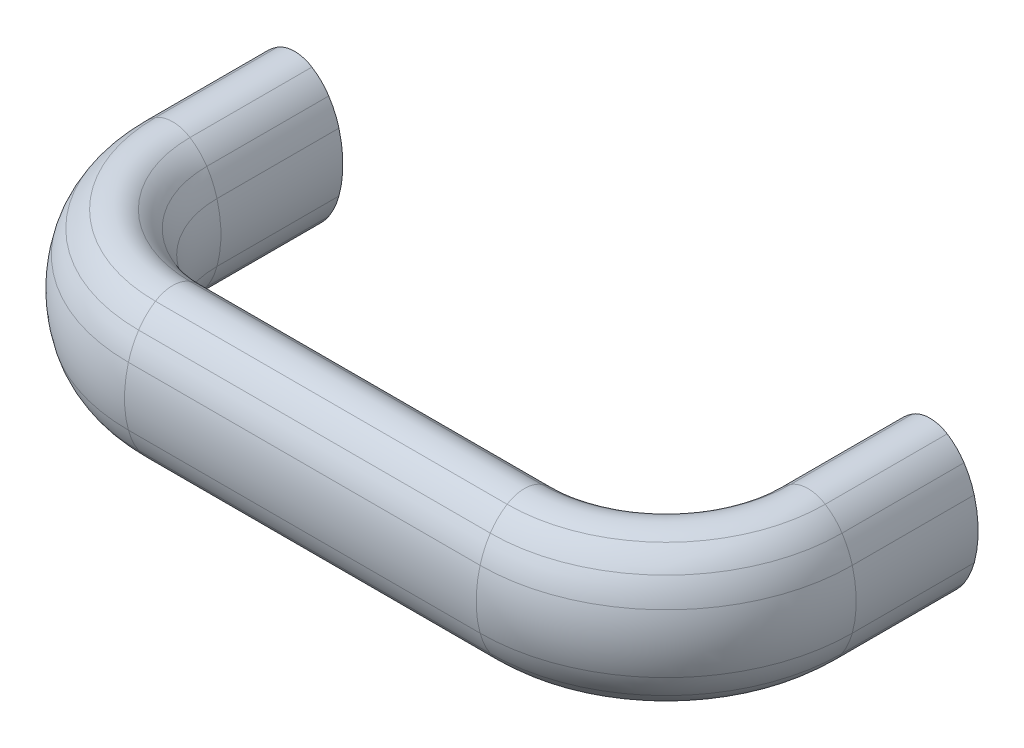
ISO-10303-21;
HEADER;
FILE_DESCRIPTION(('STEP AP214'),'2;1');
FILE_NAME('part.step','',(''),(''),'','','');
FILE_SCHEMA(('AUTOMOTIVE_DESIGN { 1 0 10303 214 1 1 1 1 }'));
ENDSEC;
DATA;
#1=APPLICATION_CONTEXT('core data for automotive mechanical design processes');
#2=APPLICATION_PROTOCOL_DEFINITION('international standard','automotive_design',2000,#1);
#3=PRODUCT_CONTEXT('',#1,'mechanical');
#4=PRODUCT('Part','Part','',(#3));
#5=PRODUCT_RELATED_PRODUCT_CATEGORY('part','',(#4));
#6=PRODUCT_DEFINITION_FORMATION('','',#4);
#7=PRODUCT_DEFINITION_CONTEXT('part definition',#1,'design');
#8=PRODUCT_DEFINITION('design','',#6,#7);
#9=PRODUCT_DEFINITION_SHAPE('','',#8);
#10=(LENGTH_UNIT() NAMED_UNIT(*) SI_UNIT(.MILLI.,.METRE.));
#11=(NAMED_UNIT(*) PLANE_ANGLE_UNIT() SI_UNIT($,.RADIAN.));
#12=(NAMED_UNIT(*) SI_UNIT($,.STERADIAN.) SOLID_ANGLE_UNIT());
#13=UNCERTAINTY_MEASURE_WITH_UNIT(LENGTH_MEASURE(1.E-05),#10,'distance_accuracy_value','');
#14=(GEOMETRIC_REPRESENTATION_CONTEXT(3) GLOBAL_UNCERTAINTY_ASSIGNED_CONTEXT((#13)) GLOBAL_UNIT_ASSIGNED_CONTEXT((#10,
#11,#12)) REPRESENTATION_CONTEXT('',''));
#15=CARTESIAN_POINT('',(0.,0.,0.));
#16=DIRECTION('',(0.,0.,1.));
#17=DIRECTION('',(1.,0.,0.));
#18=AXIS2_PLACEMENT_3D('',#15,#16,#17);
#19=CARTESIAN_POINT('',(113.109030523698,-5.56286935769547,0.));
#20=DIRECTION('',(0.,0.,-1.));
#21=DIRECTION('',(0.,-1.,0.));
#22=AXIS2_PLACEMENT_3D('',#19,#20,#21);
#23=PLANE('',#22);
#24=CARTESIAN_POINT('',(112.00009954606,-7.31334380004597,0.));
#25=DIRECTION('',(0.,0.,-1.));
#26=DIRECTION('',(0.,-1.,0.));
#27=AXIS2_PLACEMENT_3D('',#24,#25,#26);
#28=CIRCLE('',#27,5.68668538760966);
#29=CARTESIAN_POINT('',(115.043354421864,-12.1171954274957,0.));
#30=VERTEX_POINT('',#29);
#31=CARTESIAN_POINT('',(108.956844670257,-12.1171954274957,0.));
#32=VERTEX_POINT('',#31);
#33=EDGE_CURVE('E540',#30,#32,#28,.T.);
#34=ORIENTED_EDGE('',*,*,#33,.T.);
#35=CARTESIAN_POINT('',(114.217961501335,-3.81239491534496,0.));
#36=DIRECTION('',(0.,0.,-1.));
#37=DIRECTION('',(0.,-1.,0.));
#38=AXIS2_PLACEMENT_3D('',#35,#36,#37);
#39=CIRCLE('',#38,9.83102547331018);
#40=CARTESIAN_POINT('',(105.989691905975,-9.19241734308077,0.));
#41=VERTEX_POINT('',#40);
#42=EDGE_CURVE('E18',#32,#41,#39,.T.);
#43=ORIENTED_EDGE('',*,*,#42,.T.);
#44=CARTESIAN_POINT('',(117.73998277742,-1.50953485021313,0.));
#45=DIRECTION('',(0.,0.,-1.));
#46=DIRECTION('',(0.,-1.,0.));
#47=AXIS2_PLACEMENT_3D('',#44,#45,#46);
#48=CIRCLE('',#47,14.0390889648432);
#49=CARTESIAN_POINT('',(104.189079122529,-5.17955243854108,0.));
#50=VERTEX_POINT('',#49);
#51=EDGE_CURVE('E38',#41,#50,#48,.T.);
#52=ORIENTED_EDGE('',*,*,#51,.T.);
#53=CARTESIAN_POINT('',(123.313570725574,-2.91876555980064E-05,0.));
#54=DIRECTION('',(0.,0.,-1.));
#55=DIRECTION('',(0.,-1.,0.));
#56=AXIS2_PLACEMENT_3D('',#53,#54,#55);
#57=CIRCLE('',#56,19.8134711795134);
#58=CARTESIAN_POINT('',(104.189079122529,5.17949406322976,0.));
#59=VERTEX_POINT('',#58);
#60=EDGE_CURVE('E623',#50,#59,#57,.T.);
#61=ORIENTED_EDGE('',*,*,#60,.T.);
#62=CARTESIAN_POINT('',(117.73998277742,1.50947647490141,0.));
#63=DIRECTION('',(0.,0.,-1.));
#64=DIRECTION('',(0.,-1.,0.));
#65=AXIS2_PLACEMENT_3D('',#62,#63,#64);
#66=CIRCLE('',#65,14.0390889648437);
#67=CARTESIAN_POINT('',(105.989691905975,9.19235896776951,0.));
#68=VERTEX_POINT('',#67);
#69=EDGE_CURVE('E620',#59,#68,#66,.T.);
#70=ORIENTED_EDGE('',*,*,#69,.T.);
#71=CARTESIAN_POINT('',(114.217961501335,3.81233654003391,0.));
#72=DIRECTION('',(0.,0.,-1.));
#73=DIRECTION('',(0.,-1.,0.));
#74=AXIS2_PLACEMENT_3D('',#71,#72,#73);
#75=CIRCLE('',#74,9.83102547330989);
#76=CARTESIAN_POINT('',(108.956844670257,12.1171370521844,0.));
#77=VERTEX_POINT('',#76);
#78=EDGE_CURVE('E617',#68,#77,#75,.T.);
#79=ORIENTED_EDGE('',*,*,#78,.T.);
#80=CARTESIAN_POINT('',(112.00009954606,7.31328542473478,0.));
#81=DIRECTION('',(0.,0.,1.));
#82=DIRECTION('',(0.,1.,0.));
#83=AXIS2_PLACEMENT_3D('',#80,#81,#82);
#84=CIRCLE('',#83,5.68668538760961);
#85=CARTESIAN_POINT('',(115.043354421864,12.1171370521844,0.));
#86=VERTEX_POINT('',#85);
#87=EDGE_CURVE('E615',#86,#77,#84,.T.);
#88=ORIENTED_EDGE('',*,*,#87,.F.);
#89=CARTESIAN_POINT('',(109.782237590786,3.81233654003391,0.));
#90=DIRECTION('',(0.,0.,1.));
#91=DIRECTION('',(0.,1.,0.));
#92=AXIS2_PLACEMENT_3D('',#89,#90,#91);
#93=CIRCLE('',#92,9.83102547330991);
#94=CARTESIAN_POINT('',(118.010507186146,9.19235896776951,0.));
#95=VERTEX_POINT('',#94);
#96=EDGE_CURVE('E613',#95,#86,#93,.T.);
#97=ORIENTED_EDGE('',*,*,#96,.F.);
#98=CARTESIAN_POINT('',(106.260216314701,1.50947647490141,0.));
#99=DIRECTION('',(0.,0.,1.));
#100=DIRECTION('',(0.,1.,0.));
#101=AXIS2_PLACEMENT_3D('',#98,#99,#100);
#102=CIRCLE('',#101,14.0390889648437);
#103=CARTESIAN_POINT('',(119.811119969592,5.17949406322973,0.));
#104=VERTEX_POINT('',#103);
#105=EDGE_CURVE('E611',#104,#95,#102,.T.);
#106=ORIENTED_EDGE('',*,*,#105,.F.);
#107=CARTESIAN_POINT('',(100.686628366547,-2.91876557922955E-05,0.));
#108=DIRECTION('',(0.,0.,1.));
#109=DIRECTION('',(0.,1.,0.));
#110=AXIS2_PLACEMENT_3D('',#107,#108,#109);
#111=CIRCLE('',#110,19.8134711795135);
#112=CARTESIAN_POINT('',(119.811119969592,-5.17955243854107,0.));
#113=VERTEX_POINT('',#112);
#114=EDGE_CURVE('E609',#113,#104,#111,.T.);
#115=ORIENTED_EDGE('',*,*,#114,.F.);
#116=CARTESIAN_POINT('',(106.260216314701,-1.50953485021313,0.));
#117=DIRECTION('',(0.,0.,1.));
#118=DIRECTION('',(0.,1.,0.));
#119=AXIS2_PLACEMENT_3D('',#116,#117,#118);
#120=CIRCLE('',#119,14.0390889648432);
#121=CARTESIAN_POINT('',(118.010507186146,-9.19241734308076,0.));
#122=VERTEX_POINT('',#121);
#123=EDGE_CURVE('E607',#122,#113,#120,.T.);
#124=ORIENTED_EDGE('',*,*,#123,.F.);
#125=CARTESIAN_POINT('',(109.782237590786,-3.81239491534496,0.));
#126=DIRECTION('',(0.,0.,1.));
#127=DIRECTION('',(0.,1.,0.));
#128=AXIS2_PLACEMENT_3D('',#125,#126,#127);
#129=CIRCLE('',#128,9.83102547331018);
#130=EDGE_CURVE('E605',#30,#122,#129,.T.);
#131=ORIENTED_EDGE('',*,*,#130,.F.);
#132=EDGE_LOOP('',(#34,#43,#52,#61,#70,#79,#88,#97,#106,#115,#124,#131));
#133=FACE_BOUND('',#132,.T.);
#134=CARTESIAN_POINT('',(112.,0.,0.));
#135=DIRECTION('',(0.,0.,1.));
#136=DIRECTION('',(0.,1.,0.));
#137=AXIS2_PLACEMENT_3D('',#134,#135,#136);
#138=CIRCLE('',#137,4.52350000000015);
#139=CARTESIAN_POINT('',(112.,4.52350000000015,0.));
#140=VERTEX_POINT('',#139);
#141=EDGE_CURVE('E1382',#140,#140,#138,.T.);
#142=ORIENTED_EDGE('',*,*,#141,.T.);
#143=EDGE_LOOP('',(#142));
#144=FACE_BOUND('',#143,.T.);
#145=ADVANCED_FACE('F14',(#133,#144),#23,.T.);
#146=CARTESIAN_POINT('',(-1.1090305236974,-5.56286935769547,0.));
#147=DIRECTION('',(0.,0.,1.));
#148=DIRECTION('',(0.,-1.,0.));
#149=AXIS2_PLACEMENT_3D('',#146,#147,#148);
#150=PLANE('',#149);
#151=CARTESIAN_POINT('',(-9.95460602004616E-05,-7.31334380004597,0.));
#152=DIRECTION('',(0.,0.,1.));
#153=DIRECTION('',(0.,-1.,0.));
#154=AXIS2_PLACEMENT_3D('',#151,#152,#153);
#155=CIRCLE('',#154,5.68668538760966);
#156=CARTESIAN_POINT('',(-3.0433544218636,-12.1171954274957,0.));
#157=VERTEX_POINT('',#156);
#158=CARTESIAN_POINT('',(3.04315532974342,-12.1171954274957,0.));
#159=VERTEX_POINT('',#158);
#160=EDGE_CURVE('E264',#157,#159,#155,.T.);
#161=ORIENTED_EDGE('',*,*,#160,.F.);
#162=CARTESIAN_POINT('',(2.21776240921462,-3.81239491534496,0.));
#163=DIRECTION('',(0.,0.,-1.));
#164=DIRECTION('',(0.,1.,0.));
#165=AXIS2_PLACEMENT_3D('',#162,#163,#164);
#166=CIRCLE('',#165,9.83102547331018);
#167=CARTESIAN_POINT('',(-6.01050718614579,-9.19241734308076,0.));
#168=VERTEX_POINT('',#167);
#169=EDGE_CURVE('E305',#157,#168,#166,.T.);
#170=ORIENTED_EDGE('',*,*,#169,.T.);
#171=CARTESIAN_POINT('',(5.7397836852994,-1.50953485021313,0.));
#172=DIRECTION('',(0.,0.,-1.));
#173=DIRECTION('',(0.,1.,0.));
#174=AXIS2_PLACEMENT_3D('',#171,#172,#173);
#175=CIRCLE('',#174,14.0390889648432);
#176=CARTESIAN_POINT('',(-7.81111996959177,-5.17955243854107,0.));
#177=VERTEX_POINT('',#176);
#178=EDGE_CURVE('E302',#168,#177,#175,.T.);
#179=ORIENTED_EDGE('',*,*,#178,.T.);
#180=CARTESIAN_POINT('',(11.3133716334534,-2.91876557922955E-05,0.));
#181=DIRECTION('',(0.,0.,-1.));
#182=DIRECTION('',(0.,1.,0.));
#183=AXIS2_PLACEMENT_3D('',#180,#181,#182);
#184=CIRCLE('',#183,19.8134711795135);
#185=CARTESIAN_POINT('',(-7.811119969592,5.17949406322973,0.));
#186=VERTEX_POINT('',#185);
#187=EDGE_CURVE('E299',#177,#186,#184,.T.);
#188=ORIENTED_EDGE('',*,*,#187,.T.);
#189=CARTESIAN_POINT('',(5.73978368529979,1.50947647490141,0.));
#190=DIRECTION('',(0.,0.,-1.));
#191=DIRECTION('',(0.,1.,0.));
#192=AXIS2_PLACEMENT_3D('',#189,#190,#191);
#193=CIRCLE('',#192,14.0390889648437);
#194=CARTESIAN_POINT('',(-6.01050718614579,9.19235896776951,0.));
#195=VERTEX_POINT('',#194);
#196=EDGE_CURVE('E296',#186,#195,#193,.T.);
#197=ORIENTED_EDGE('',*,*,#196,.T.);
#198=CARTESIAN_POINT('',(2.21776240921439,3.81233654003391,0.));
#199=DIRECTION('',(0.,0.,-1.));
#200=DIRECTION('',(0.,1.,0.));
#201=AXIS2_PLACEMENT_3D('',#198,#199,#200);
#202=CIRCLE('',#201,9.83102547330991);
#203=CARTESIAN_POINT('',(-3.0433544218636,12.1171370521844,0.));
#204=VERTEX_POINT('',#203);
#205=EDGE_CURVE('E293',#195,#204,#202,.T.);
#206=ORIENTED_EDGE('',*,*,#205,.T.);
#207=CARTESIAN_POINT('',(-9.95460602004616E-05,7.31328542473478,0.));
#208=DIRECTION('',(0.,0.,1.));
#209=DIRECTION('',(0.,-1.,0.));
#210=AXIS2_PLACEMENT_3D('',#207,#208,#209);
#211=CIRCLE('',#210,5.68668538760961);
#212=CARTESIAN_POINT('',(3.04315532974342,12.1171370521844,0.));
#213=VERTEX_POINT('',#212);
#214=EDGE_CURVE('E291',#213,#204,#211,.T.);
#215=ORIENTED_EDGE('',*,*,#214,.F.);
#216=CARTESIAN_POINT('',(-2.21796150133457,3.81233654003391,0.));
#217=DIRECTION('',(0.,0.,1.));
#218=DIRECTION('',(0.,-1.,0.));
#219=AXIS2_PLACEMENT_3D('',#216,#217,#218);
#220=CIRCLE('',#219,9.83102547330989);
#221=CARTESIAN_POINT('',(6.01030809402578,9.19235896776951,0.));
#222=VERTEX_POINT('',#221);
#223=EDGE_CURVE('E288',#222,#213,#220,.T.);
#224=ORIENTED_EDGE('',*,*,#223,.F.);
#225=CARTESIAN_POINT('',(-5.7399827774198,1.50947647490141,0.));
#226=DIRECTION('',(0.,0.,1.));
#227=DIRECTION('',(0.,-1.,0.));
#228=AXIS2_PLACEMENT_3D('',#225,#226,#227);
#229=CIRCLE('',#228,14.0390889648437);
#230=CARTESIAN_POINT('',(7.81092087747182,5.17949406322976,0.));
#231=VERTEX_POINT('',#230);
#232=EDGE_CURVE('E285',#231,#222,#229,.T.);
#233=ORIENTED_EDGE('',*,*,#232,.F.);
#234=CARTESIAN_POINT('',(-11.3135707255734,-2.91876555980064E-05,0.));
#235=DIRECTION('',(0.,0.,1.));
#236=DIRECTION('',(0.,-1.,0.));
#237=AXIS2_PLACEMENT_3D('',#234,#235,#236);
#238=CIRCLE('',#237,19.8134711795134);
#239=CARTESIAN_POINT('',(7.81092087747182,-5.17955243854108,0.));
#240=VERTEX_POINT('',#239);
#241=EDGE_CURVE('E279',#240,#231,#238,.T.);
#242=ORIENTED_EDGE('',*,*,#241,.F.);
#243=CARTESIAN_POINT('',(-5.73998277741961,-1.50953485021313,0.));
#244=DIRECTION('',(0.,0.,1.));
#245=DIRECTION('',(0.,-1.,0.));
#246=AXIS2_PLACEMENT_3D('',#243,#244,#245);
#247=CIRCLE('',#246,14.0390889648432);
#248=CARTESIAN_POINT('',(6.01030809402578,-9.19241734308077,0.));
#249=VERTEX_POINT('',#248);
#250=EDGE_CURVE('E277',#249,#240,#247,.T.);
#251=ORIENTED_EDGE('',*,*,#250,.F.);
#252=CARTESIAN_POINT('',(-2.2179615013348,-3.81239491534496,0.));
#253=DIRECTION('',(0.,0.,1.));
#254=DIRECTION('',(0.,-1.,0.));
#255=AXIS2_PLACEMENT_3D('',#252,#253,#254);
#256=CIRCLE('',#255,9.83102547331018);
#257=EDGE_CURVE('E255',#159,#249,#256,.T.);
#258=ORIENTED_EDGE('',*,*,#257,.F.);
#259=EDGE_LOOP('',(#161,#170,#179,#188,#197,#206,#215,#224,#233,#242,#251,#258));
#260=FACE_BOUND('',#259,.T.);
#261=CARTESIAN_POINT('',(0.,0.,0.));
#262=DIRECTION('',(0.,0.,-1.));
#263=DIRECTION('',(0.,1.,0.));
#264=AXIS2_PLACEMENT_3D('',#261,#262,#263);
#265=CIRCLE('',#264,4.52350000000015);
#266=CARTESIAN_POINT('',(0.,4.52350000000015,0.));
#267=VERTEX_POINT('',#266);
#268=EDGE_CURVE('E1390',#267,#267,#265,.T.);
#269=ORIENTED_EDGE('',*,*,#268,.F.);
#270=EDGE_LOOP('',(#269));
#271=FACE_BOUND('',#270,.T.);
#272=ADVANCED_FACE('F273',(#260,#271),#150,.F.);
#273=CARTESIAN_POINT('',(114.217961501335,-3.81239491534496,21.5));
#274=DIRECTION('',(0.,0.,-1.));
#275=DIRECTION('',(0.,1.,0.));
#276=AXIS2_PLACEMENT_3D('',#273,#274,#275);
#277=CYLINDRICAL_SURFACE('',#276,9.83102547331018);
#278=CARTESIAN_POINT('',(114.217961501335,-3.81239491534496,21.5));
#279=DIRECTION('',(0.,0.,-1.));
#280=DIRECTION('',(0.,-1.,0.));
#281=AXIS2_PLACEMENT_3D('',#278,#279,#280);
#282=CIRCLE('',#281,9.83102547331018);
#283=CARTESIAN_POINT('',(108.956844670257,-12.1171954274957,21.5));
#284=VERTEX_POINT('',#283);
#285=CARTESIAN_POINT('',(105.989691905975,-9.19241734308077,21.5));
#286=VERTEX_POINT('',#285);
#287=EDGE_CURVE('E507',#284,#286,#282,.T.);
#288=ORIENTED_EDGE('',*,*,#287,.T.);
#289=DIRECTION('',(0.,0.,-1.));
#290=VECTOR('',#289,1.);
#291=CARTESIAN_POINT('',(105.989691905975,-9.19241734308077,21.5));
#292=LINE('',#291,#290);
#293=EDGE_CURVE('E23',#286,#41,#292,.T.);
#294=ORIENTED_EDGE('',*,*,#293,.T.);
#295=ORIENTED_EDGE('',*,*,#42,.F.);
#296=DIRECTION('',(0.,0.,-1.));
#297=VECTOR('',#296,1.);
#298=CARTESIAN_POINT('',(108.956844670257,-12.1171954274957,21.5));
#299=LINE('',#298,#297);
#300=EDGE_CURVE('E9',#284,#32,#299,.T.);
#301=ORIENTED_EDGE('',*,*,#300,.F.);
#302=EDGE_LOOP('',(#288,#294,#295,#301));
#303=FACE_BOUND('',#302,.T.);
#304=ADVANCED_FACE('F16',(#303),#277,.T.);
#305=CARTESIAN_POINT('',(117.73998277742,-1.50953485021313,21.5));
#306=DIRECTION('',(0.,0.,-1.));
#307=DIRECTION('',(0.,1.,0.));
#308=AXIS2_PLACEMENT_3D('',#305,#306,#307);
#309=CYLINDRICAL_SURFACE('',#308,14.0390889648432);
#310=CARTESIAN_POINT('',(117.73998277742,-1.50953485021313,21.5));
#311=DIRECTION('',(0.,0.,-1.));
#312=DIRECTION('',(0.,-1.,0.));
#313=AXIS2_PLACEMENT_3D('',#310,#311,#312);
#314=CIRCLE('',#313,14.0390889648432);
#315=CARTESIAN_POINT('',(104.189079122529,-5.17955243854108,21.5));
#316=VERTEX_POINT('',#315);
#317=EDGE_CURVE('E569',#286,#316,#314,.T.);
#318=ORIENTED_EDGE('',*,*,#317,.T.);
#319=DIRECTION('',(0.,0.,-1.));
#320=VECTOR('',#319,1.);
#321=CARTESIAN_POINT('',(104.189079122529,-5.17955243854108,21.5));
#322=LINE('',#321,#320);
#323=EDGE_CURVE('E601',#316,#50,#322,.T.);
#324=ORIENTED_EDGE('',*,*,#323,.T.);
#325=ORIENTED_EDGE('',*,*,#51,.F.);
#326=ORIENTED_EDGE('',*,*,#293,.F.);
#327=EDGE_LOOP('',(#318,#324,#325,#326));
#328=FACE_BOUND('',#327,.T.);
#329=ADVANCED_FACE('F630',(#328),#309,.T.);
#330=CARTESIAN_POINT('',(123.313570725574,-2.91876555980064E-05,21.5));
#331=DIRECTION('',(0.,0.,-1.));
#332=DIRECTION('',(0.,1.,0.));
#333=AXIS2_PLACEMENT_3D('',#330,#331,#332);
#334=CYLINDRICAL_SURFACE('',#333,19.8134711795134);
#335=CARTESIAN_POINT('',(123.313570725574,-2.91876555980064E-05,21.5));
#336=DIRECTION('',(0.,0.,-1.));
#337=DIRECTION('',(0.,-1.,0.));
#338=AXIS2_PLACEMENT_3D('',#335,#336,#337);
#339=CIRCLE('',#338,19.8134711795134);
#340=CARTESIAN_POINT('',(104.189079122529,5.17949406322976,21.5));
#341=VERTEX_POINT('',#340);
#342=EDGE_CURVE('E566',#316,#341,#339,.T.);
#343=ORIENTED_EDGE('',*,*,#342,.T.);
#344=DIRECTION('',(0.,0.,-1.));
#345=VECTOR('',#344,1.);
#346=CARTESIAN_POINT('',(104.189079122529,5.17949406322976,21.5));
#347=LINE('',#346,#345);
#348=EDGE_CURVE('E598',#341,#59,#347,.T.);
#349=ORIENTED_EDGE('',*,*,#348,.T.);
#350=ORIENTED_EDGE('',*,*,#60,.F.);
#351=ORIENTED_EDGE('',*,*,#323,.F.);
#352=EDGE_LOOP('',(#343,#349,#350,#351));
#353=FACE_BOUND('',#352,.T.);
#354=ADVANCED_FACE('F685',(#353),#334,.T.);
#355=CARTESIAN_POINT('',(117.73998277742,1.50947647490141,21.5));
#356=DIRECTION('',(0.,0.,-1.));
#357=DIRECTION('',(0.,1.,0.));
#358=AXIS2_PLACEMENT_3D('',#355,#356,#357);
#359=CYLINDRICAL_SURFACE('',#358,14.0390889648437);
#360=CARTESIAN_POINT('',(117.73998277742,1.50947647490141,21.5));
#361=DIRECTION('',(0.,0.,-1.));
#362=DIRECTION('',(0.,-1.,0.));
#363=AXIS2_PLACEMENT_3D('',#360,#361,#362);
#364=CIRCLE('',#363,14.0390889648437);
#365=CARTESIAN_POINT('',(105.989691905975,9.19235896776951,21.5));
#366=VERTEX_POINT('',#365);
#367=EDGE_CURVE('E563',#341,#366,#364,.T.);
#368=ORIENTED_EDGE('',*,*,#367,.T.);
#369=DIRECTION('',(0.,0.,-1.));
#370=VECTOR('',#369,1.);
#371=CARTESIAN_POINT('',(105.989691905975,9.19235896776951,21.5));
#372=LINE('',#371,#370);
#373=EDGE_CURVE('E595',#366,#68,#372,.T.);
#374=ORIENTED_EDGE('',*,*,#373,.T.);
#375=ORIENTED_EDGE('',*,*,#69,.F.);
#376=ORIENTED_EDGE('',*,*,#348,.F.);
#377=EDGE_LOOP('',(#368,#374,#375,#376));
#378=FACE_BOUND('',#377,.T.);
#379=ADVANCED_FACE('F684',(#378),#359,.T.);
#380=CARTESIAN_POINT('',(114.217961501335,3.81233654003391,21.5));
#381=DIRECTION('',(0.,0.,-1.));
#382=DIRECTION('',(0.,1.,0.));
#383=AXIS2_PLACEMENT_3D('',#380,#381,#382);
#384=CYLINDRICAL_SURFACE('',#383,9.83102547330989);
#385=CARTESIAN_POINT('',(114.217961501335,3.81233654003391,21.5));
#386=DIRECTION('',(0.,0.,-1.));
#387=DIRECTION('',(0.,-1.,0.));
#388=AXIS2_PLACEMENT_3D('',#385,#386,#387);
#389=CIRCLE('',#388,9.83102547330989);
#390=CARTESIAN_POINT('',(108.956844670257,12.1171370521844,21.5));
#391=VERTEX_POINT('',#390);
#392=EDGE_CURVE('E560',#366,#391,#389,.T.);
#393=ORIENTED_EDGE('',*,*,#392,.T.);
#394=DIRECTION('',(0.,0.,-1.));
#395=VECTOR('',#394,1.);
#396=CARTESIAN_POINT('',(108.956844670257,12.1171370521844,21.5));
#397=LINE('',#396,#395);
#398=EDGE_CURVE('E592',#391,#77,#397,.T.);
#399=ORIENTED_EDGE('',*,*,#398,.T.);
#400=ORIENTED_EDGE('',*,*,#78,.F.);
#401=ORIENTED_EDGE('',*,*,#373,.F.);
#402=EDGE_LOOP('',(#393,#399,#400,#401));
#403=FACE_BOUND('',#402,.T.);
#404=ADVANCED_FACE('F690',(#403),#384,.T.);
#405=CARTESIAN_POINT('',(112.00009954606,7.31328542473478,21.5));
#406=DIRECTION('',(0.,0.,-1.));
#407=DIRECTION('',(0.,1.,0.));
#408=AXIS2_PLACEMENT_3D('',#405,#406,#407);
#409=CYLINDRICAL_SURFACE('',#408,5.68668538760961);
#410=CARTESIAN_POINT('',(112.00009954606,7.31328542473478,21.5));
#411=DIRECTION('',(0.,0.,1.));
#412=DIRECTION('',(0.,1.,0.));
#413=AXIS2_PLACEMENT_3D('',#410,#411,#412);
#414=CIRCLE('',#413,5.68668538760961);
#415=CARTESIAN_POINT('',(115.043354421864,12.1171370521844,21.5));
#416=VERTEX_POINT('',#415);
#417=EDGE_CURVE('E558',#416,#391,#414,.T.);
#418=ORIENTED_EDGE('',*,*,#417,.F.);
#419=DIRECTION('',(0.,0.,-1.));
#420=VECTOR('',#419,1.);
#421=CARTESIAN_POINT('',(115.043354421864,12.1171370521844,21.5));
#422=LINE('',#421,#420);
#423=EDGE_CURVE('E589',#416,#86,#422,.T.);
#424=ORIENTED_EDGE('',*,*,#423,.T.);
#425=ORIENTED_EDGE('',*,*,#87,.T.);
#426=ORIENTED_EDGE('',*,*,#398,.F.);
#427=EDGE_LOOP('',(#418,#424,#425,#426));
#428=FACE_BOUND('',#427,.T.);
#429=ADVANCED_FACE('F693',(#428),#409,.T.);
#430=CARTESIAN_POINT('',(109.782237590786,3.81233654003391,21.5));
#431=DIRECTION('',(0.,0.,-1.));
#432=DIRECTION('',(0.,1.,0.));
#433=AXIS2_PLACEMENT_3D('',#430,#431,#432);
#434=CYLINDRICAL_SURFACE('',#433,9.83102547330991);
#435=CARTESIAN_POINT('',(109.782237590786,3.81233654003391,21.5));
#436=DIRECTION('',(0.,0.,1.));
#437=DIRECTION('',(0.,1.,0.));
#438=AXIS2_PLACEMENT_3D('',#435,#436,#437);
#439=CIRCLE('',#438,9.83102547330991);
#440=CARTESIAN_POINT('',(118.010507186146,9.19235896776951,21.5));
#441=VERTEX_POINT('',#440);
#442=EDGE_CURVE('E555',#441,#416,#439,.T.);
#443=ORIENTED_EDGE('',*,*,#442,.F.);
#444=DIRECTION('',(0.,0.,-1.));
#445=VECTOR('',#444,1.);
#446=CARTESIAN_POINT('',(118.010507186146,9.19235896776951,21.5));
#447=LINE('',#446,#445);
#448=EDGE_CURVE('E586',#441,#95,#447,.T.);
#449=ORIENTED_EDGE('',*,*,#448,.T.);
#450=ORIENTED_EDGE('',*,*,#96,.T.);
#451=ORIENTED_EDGE('',*,*,#423,.F.);
#452=EDGE_LOOP('',(#443,#449,#450,#451));
#453=FACE_BOUND('',#452,.T.);
#454=ADVANCED_FACE('F696',(#453),#434,.T.);
#455=CARTESIAN_POINT('',(106.260216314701,1.50947647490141,21.5));
#456=DIRECTION('',(0.,0.,-1.));
#457=DIRECTION('',(0.,1.,0.));
#458=AXIS2_PLACEMENT_3D('',#455,#456,#457);
#459=CYLINDRICAL_SURFACE('',#458,14.0390889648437);
#460=CARTESIAN_POINT('',(106.260216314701,1.50947647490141,21.5));
#461=DIRECTION('',(0.,0.,1.));
#462=DIRECTION('',(0.,1.,0.));
#463=AXIS2_PLACEMENT_3D('',#460,#461,#462);
#464=CIRCLE('',#463,14.0390889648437);
#465=CARTESIAN_POINT('',(119.811119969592,5.17949406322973,21.5));
#466=VERTEX_POINT('',#465);
#467=EDGE_CURVE('E552',#466,#441,#464,.T.);
#468=ORIENTED_EDGE('',*,*,#467,.F.);
#469=DIRECTION('',(0.,0.,-1.));
#470=VECTOR('',#469,1.);
#471=CARTESIAN_POINT('',(119.811119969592,5.17949406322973,21.5));
#472=LINE('',#471,#470);
#473=EDGE_CURVE('E583',#466,#104,#472,.T.);
#474=ORIENTED_EDGE('',*,*,#473,.T.);
#475=ORIENTED_EDGE('',*,*,#105,.T.);
#476=ORIENTED_EDGE('',*,*,#448,.F.);
#477=EDGE_LOOP('',(#468,#474,#475,#476));
#478=FACE_BOUND('',#477,.T.);
#479=ADVANCED_FACE('F702',(#478),#459,.T.);
#480=CARTESIAN_POINT('',(100.686628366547,-2.91876557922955E-05,21.5));
#481=DIRECTION('',(0.,0.,-1.));
#482=DIRECTION('',(0.,1.,0.));
#483=AXIS2_PLACEMENT_3D('',#480,#481,#482);
#484=CYLINDRICAL_SURFACE('',#483,19.8134711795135);
#485=CARTESIAN_POINT('',(100.686628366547,-2.91876557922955E-05,21.5));
#486=DIRECTION('',(0.,0.,1.));
#487=DIRECTION('',(0.,1.,0.));
#488=AXIS2_PLACEMENT_3D('',#485,#486,#487);
#489=CIRCLE('',#488,19.8134711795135);
#490=CARTESIAN_POINT('',(119.811119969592,-5.17955243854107,21.5));
#491=VERTEX_POINT('',#490);
#492=EDGE_CURVE('E549',#491,#466,#489,.T.);
#493=ORIENTED_EDGE('',*,*,#492,.F.);
#494=DIRECTION('',(0.,0.,-1.));
#495=VECTOR('',#494,1.);
#496=CARTESIAN_POINT('',(119.811119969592,-5.17955243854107,21.5));
#497=LINE('',#496,#495);
#498=EDGE_CURVE('E580',#491,#113,#497,.T.);
#499=ORIENTED_EDGE('',*,*,#498,.T.);
#500=ORIENTED_EDGE('',*,*,#114,.T.);
#501=ORIENTED_EDGE('',*,*,#473,.F.);
#502=EDGE_LOOP('',(#493,#499,#500,#501));
#503=FACE_BOUND('',#502,.T.);
#504=ADVANCED_FACE('F705',(#503),#484,.T.);
#505=CARTESIAN_POINT('',(106.260216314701,-1.50953485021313,21.5));
#506=DIRECTION('',(0.,0.,-1.));
#507=DIRECTION('',(0.,1.,0.));
#508=AXIS2_PLACEMENT_3D('',#505,#506,#507);
#509=CYLINDRICAL_SURFACE('',#508,14.0390889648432);
#510=CARTESIAN_POINT('',(106.260216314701,-1.50953485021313,21.5));
#511=DIRECTION('',(0.,0.,1.));
#512=DIRECTION('',(0.,1.,0.));
#513=AXIS2_PLACEMENT_3D('',#510,#511,#512);
#514=CIRCLE('',#513,14.0390889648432);
#515=CARTESIAN_POINT('',(118.010507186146,-9.19241734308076,21.5));
#516=VERTEX_POINT('',#515);
#517=EDGE_CURVE('E546',#516,#491,#514,.T.);
#518=ORIENTED_EDGE('',*,*,#517,.F.);
#519=DIRECTION('',(0.,0.,-1.));
#520=VECTOR('',#519,1.);
#521=CARTESIAN_POINT('',(118.010507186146,-9.19241734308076,21.5));
#522=LINE('',#521,#520);
#523=EDGE_CURVE('E577',#516,#122,#522,.T.);
#524=ORIENTED_EDGE('',*,*,#523,.T.);
#525=ORIENTED_EDGE('',*,*,#123,.T.);
#526=ORIENTED_EDGE('',*,*,#498,.F.);
#527=EDGE_LOOP('',(#518,#524,#525,#526));
#528=FACE_BOUND('',#527,.T.);
#529=ADVANCED_FACE('F708',(#528),#509,.T.);
#530=CARTESIAN_POINT('',(109.782237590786,-3.81239491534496,21.5));
#531=DIRECTION('',(0.,0.,-1.));
#532=DIRECTION('',(0.,1.,0.));
#533=AXIS2_PLACEMENT_3D('',#530,#531,#532);
#534=CYLINDRICAL_SURFACE('',#533,9.83102547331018);
#535=CARTESIAN_POINT('',(109.782237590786,-3.81239491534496,21.5));
#536=DIRECTION('',(0.,0.,1.));
#537=DIRECTION('',(0.,1.,0.));
#538=AXIS2_PLACEMENT_3D('',#535,#536,#537);
#539=CIRCLE('',#538,9.83102547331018);
#540=CARTESIAN_POINT('',(115.043354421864,-12.1171954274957,21.5));
#541=VERTEX_POINT('',#540);
#542=EDGE_CURVE('E543',#541,#516,#539,.T.);
#543=ORIENTED_EDGE('',*,*,#542,.F.);
#544=DIRECTION('',(0.,0.,-1.));
#545=VECTOR('',#544,1.);
#546=CARTESIAN_POINT('',(115.043354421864,-12.1171954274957,21.5));
#547=LINE('',#546,#545);
#548=EDGE_CURVE('E574',#541,#30,#547,.T.);
#549=ORIENTED_EDGE('',*,*,#548,.T.);
#550=ORIENTED_EDGE('',*,*,#130,.T.);
#551=ORIENTED_EDGE('',*,*,#523,.F.);
#552=EDGE_LOOP('',(#543,#549,#550,#551));
#553=FACE_BOUND('',#552,.T.);
#554=ADVANCED_FACE('F712',(#553),#534,.T.);
#555=CARTESIAN_POINT('',(112.00009954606,-7.31334380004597,21.5));
#556=DIRECTION('',(0.,0.,-1.));
#557=DIRECTION('',(0.,1.,0.));
#558=AXIS2_PLACEMENT_3D('',#555,#556,#557);
#559=CYLINDRICAL_SURFACE('',#558,5.68668538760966);
#560=CARTESIAN_POINT('',(112.00009954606,-7.31334380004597,21.5));
#561=DIRECTION('',(0.,0.,-1.));
#562=DIRECTION('',(0.,-1.,0.));
#563=AXIS2_PLACEMENT_3D('',#560,#561,#562);
#564=CIRCLE('',#563,5.68668538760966);
#565=EDGE_CURVE('E469',#541,#284,#564,.T.);
#566=ORIENTED_EDGE('',*,*,#565,.T.);
#567=ORIENTED_EDGE('',*,*,#300,.T.);
#568=ORIENTED_EDGE('',*,*,#33,.F.);
#569=ORIENTED_EDGE('',*,*,#548,.F.);
#570=EDGE_LOOP('',(#566,#567,#568,#569));
#571=FACE_BOUND('',#570,.T.);
#572=ADVANCED_FACE('F714',(#571),#559,.T.);
#573=CARTESIAN_POINT('',(87.,-3.81239491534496,21.5));
#574=DIRECTION('',(0.,1.,0.));
#575=DIRECTION('',(-1.,0.,0.));
#576=AXIS2_PLACEMENT_3D('',#573,#574,#575);
#577=TOROIDAL_SURFACE('',#576,27.2179615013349,9.83102547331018);
#578=CARTESIAN_POINT('',(87.,-3.81239491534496,48.7179615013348));
#579=DIRECTION('',(1.,0.,0.));
#580=DIRECTION('',(0.,-1.,0.));
#581=AXIS2_PLACEMENT_3D('',#578,#579,#580);
#582=CIRCLE('',#581,9.83102547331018);
#583=CARTESIAN_POINT('',(87.,-12.1171954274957,43.4568446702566));
#584=VERTEX_POINT('',#583);
#585=CARTESIAN_POINT('',(87.,-9.19241734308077,40.4896919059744));
#586=VERTEX_POINT('',#585);
#587=EDGE_CURVE('E436',#584,#586,#582,.T.);
#588=ORIENTED_EDGE('',*,*,#587,.T.);
#589=CARTESIAN_POINT('',(87.,-9.19241734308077,21.5));
#590=DIRECTION('',(0.,1.,0.));
#591=DIRECTION('',(-1.,0.,0.));
#592=AXIS2_PLACEMENT_3D('',#589,#590,#591);
#593=CIRCLE('',#592,18.9896919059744);
#594=EDGE_CURVE('E534',#586,#286,#593,.T.);
#595=ORIENTED_EDGE('',*,*,#594,.T.);
#596=ORIENTED_EDGE('',*,*,#287,.F.);
#597=CARTESIAN_POINT('',(87.,-12.1171954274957,21.5));
#598=DIRECTION('',(0.,1.,0.));
#599=DIRECTION('',(-1.,0.,0.));
#600=AXIS2_PLACEMENT_3D('',#597,#598,#599);
#601=CIRCLE('',#600,21.9568446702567);
#602=EDGE_CURVE('E537',#584,#284,#601,.T.);
#603=ORIENTED_EDGE('',*,*,#602,.F.);
#604=EDGE_LOOP('',(#588,#595,#596,#603));
#605=FACE_BOUND('',#604,.T.);
#606=ADVANCED_FACE('F718',(#605),#577,.T.);
#607=CARTESIAN_POINT('',(87.,-1.50953485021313,21.5));
#608=DIRECTION('',(0.,1.,0.));
#609=DIRECTION('',(-1.,0.,0.));
#610=AXIS2_PLACEMENT_3D('',#607,#608,#609);
#611=TOROIDAL_SURFACE('',#610,30.7399827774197,14.0390889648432);
#612=CARTESIAN_POINT('',(87.,-1.50953485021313,52.2399827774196));
#613=DIRECTION('',(1.,0.,0.));
#614=DIRECTION('',(0.,-1.,0.));
#615=AXIS2_PLACEMENT_3D('',#612,#613,#614);
#616=CIRCLE('',#615,14.0390889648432);
#617=CARTESIAN_POINT('',(87.,-5.17955243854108,38.6890791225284));
#618=VERTEX_POINT('',#617);
#619=EDGE_CURVE('E498',#586,#618,#616,.T.);
#620=ORIENTED_EDGE('',*,*,#619,.T.);
#621=CARTESIAN_POINT('',(87.,-5.17955243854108,21.5));
#622=DIRECTION('',(0.,1.,0.));
#623=DIRECTION('',(-1.,0.,0.));
#624=AXIS2_PLACEMENT_3D('',#621,#622,#623);
#625=CIRCLE('',#624,17.1890791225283);
#626=EDGE_CURVE('E531',#618,#316,#625,.T.);
#627=ORIENTED_EDGE('',*,*,#626,.T.);
#628=ORIENTED_EDGE('',*,*,#317,.F.);
#629=ORIENTED_EDGE('',*,*,#594,.F.);
#630=EDGE_LOOP('',(#620,#627,#628,#629));
#631=FACE_BOUND('',#630,.T.);
#632=ADVANCED_FACE('F637',(#631),#611,.T.);
#633=CARTESIAN_POINT('',(87.,-2.91876555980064E-05,21.5));
#634=DIRECTION('',(0.,1.,0.));
#635=DIRECTION('',(-1.,0.,0.));
#636=AXIS2_PLACEMENT_3D('',#633,#634,#635);
#637=TOROIDAL_SURFACE('',#636,36.3135707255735,19.8134711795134);
#638=CARTESIAN_POINT('',(87.,-2.91876555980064E-05,57.8135707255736));
#639=DIRECTION('',(1.,0.,0.));
#640=DIRECTION('',(0.,-1.,0.));
#641=AXIS2_PLACEMENT_3D('',#638,#639,#640);
#642=CIRCLE('',#641,19.8134711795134);
#643=CARTESIAN_POINT('',(87.,5.17949406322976,38.6890791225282));
#644=VERTEX_POINT('',#643);
#645=EDGE_CURVE('E495',#618,#644,#642,.T.);
#646=ORIENTED_EDGE('',*,*,#645,.T.);
#647=CARTESIAN_POINT('',(87.,5.17949406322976,21.5));
#648=DIRECTION('',(0.,1.,0.));
#649=DIRECTION('',(-1.,0.,0.));
#650=AXIS2_PLACEMENT_3D('',#647,#648,#649);
#651=CIRCLE('',#650,17.1890791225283);
#652=EDGE_CURVE('E528',#644,#341,#651,.T.);
#653=ORIENTED_EDGE('',*,*,#652,.T.);
#654=ORIENTED_EDGE('',*,*,#342,.F.);
#655=ORIENTED_EDGE('',*,*,#626,.F.);
#656=EDGE_LOOP('',(#646,#653,#654,#655));
#657=FACE_BOUND('',#656,.T.);
#658=ADVANCED_FACE('F634',(#657),#637,.T.);
#659=CARTESIAN_POINT('',(87.,1.50947647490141,21.5));
#660=DIRECTION('',(0.,1.,0.));
#661=DIRECTION('',(-1.,0.,0.));
#662=AXIS2_PLACEMENT_3D('',#659,#660,#661);
#663=TOROIDAL_SURFACE('',#662,30.73998277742,14.0390889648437);
#664=CARTESIAN_POINT('',(87.,1.50947647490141,52.23998277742));
#665=DIRECTION('',(1.,0.,0.));
#666=DIRECTION('',(0.,-1.,0.));
#667=AXIS2_PLACEMENT_3D('',#664,#665,#666);
#668=CIRCLE('',#667,14.0390889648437);
#669=CARTESIAN_POINT('',(87.,9.19235896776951,40.4896919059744));
#670=VERTEX_POINT('',#669);
#671=EDGE_CURVE('E492',#644,#670,#668,.T.);
#672=ORIENTED_EDGE('',*,*,#671,.T.);
#673=CARTESIAN_POINT('',(87.,9.19235896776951,21.5));
#674=DIRECTION('',(0.,1.,0.));
#675=DIRECTION('',(-1.,0.,0.));
#676=AXIS2_PLACEMENT_3D('',#673,#674,#675);
#677=CIRCLE('',#676,18.9896919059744);
#678=EDGE_CURVE('E525',#670,#366,#677,.T.);
#679=ORIENTED_EDGE('',*,*,#678,.T.);
#680=ORIENTED_EDGE('',*,*,#367,.F.);
#681=ORIENTED_EDGE('',*,*,#652,.F.);
#682=EDGE_LOOP('',(#672,#679,#680,#681));
#683=FACE_BOUND('',#682,.T.);
#684=ADVANCED_FACE('F682',(#683),#663,.T.);
#685=CARTESIAN_POINT('',(87.,3.81233654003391,21.5));
#686=DIRECTION('',(0.,1.,0.));
#687=DIRECTION('',(-1.,0.,0.));
#688=AXIS2_PLACEMENT_3D('',#685,#686,#687);
#689=TOROIDAL_SURFACE('',#688,27.2179615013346,9.83102547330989);
#690=CARTESIAN_POINT('',(87.,3.81233654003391,48.7179615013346));
#691=DIRECTION('',(1.,0.,0.));
#692=DIRECTION('',(0.,-1.,0.));
#693=AXIS2_PLACEMENT_3D('',#690,#691,#692);
#694=CIRCLE('',#693,9.83102547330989);
#695=CARTESIAN_POINT('',(87.,12.1171370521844,43.4568446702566));
#696=VERTEX_POINT('',#695);
#697=EDGE_CURVE('E489',#670,#696,#694,.T.);
#698=ORIENTED_EDGE('',*,*,#697,.T.);
#699=CARTESIAN_POINT('',(87.,12.1171370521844,21.5));
#700=DIRECTION('',(0.,1.,0.));
#701=DIRECTION('',(-1.,0.,0.));
#702=AXIS2_PLACEMENT_3D('',#699,#700,#701);
#703=CIRCLE('',#702,21.9568446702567);
#704=EDGE_CURVE('E522',#696,#391,#703,.T.);
#705=ORIENTED_EDGE('',*,*,#704,.T.);
#706=ORIENTED_EDGE('',*,*,#392,.F.);
#707=ORIENTED_EDGE('',*,*,#678,.F.);
#708=EDGE_LOOP('',(#698,#705,#706,#707));
#709=FACE_BOUND('',#708,.T.);
#710=ADVANCED_FACE('F678',(#709),#689,.T.);
#711=CARTESIAN_POINT('',(87.,7.31328542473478,21.5));
#712=DIRECTION('',(0.,1.,0.));
#713=DIRECTION('',(-1.,0.,0.));
#714=AXIS2_PLACEMENT_3D('',#711,#712,#713);
#715=TOROIDAL_SURFACE('',#714,25.0000995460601,5.68668538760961);
#716=CARTESIAN_POINT('',(87.,7.31328542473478,46.5000995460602));
#717=DIRECTION('',(-1.,0.,0.));
#718=DIRECTION('',(0.,1.,0.));
#719=AXIS2_PLACEMENT_3D('',#716,#717,#718);
#720=CIRCLE('',#719,5.68668538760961);
#721=CARTESIAN_POINT('',(87.,12.1171370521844,49.5433544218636));
#722=VERTEX_POINT('',#721);
#723=EDGE_CURVE('E487',#722,#696,#720,.T.);
#724=ORIENTED_EDGE('',*,*,#723,.F.);
#725=CARTESIAN_POINT('',(87.,12.1171370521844,21.5));
#726=DIRECTION('',(0.,1.,0.));
#727=DIRECTION('',(-1.,0.,0.));
#728=AXIS2_PLACEMENT_3D('',#725,#726,#727);
#729=CIRCLE('',#728,28.0433544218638);
#730=EDGE_CURVE('E519',#722,#416,#729,.T.);
#731=ORIENTED_EDGE('',*,*,#730,.T.);
#732=ORIENTED_EDGE('',*,*,#417,.T.);
#733=ORIENTED_EDGE('',*,*,#704,.F.);
#734=EDGE_LOOP('',(#724,#731,#732,#733));
#735=FACE_BOUND('',#734,.T.);
#736=ADVANCED_FACE('F1023',(#735),#715,.T.);
#737=CARTESIAN_POINT('',(87.,3.81233654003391,21.5));
#738=DIRECTION('',(0.,1.,0.));
#739=DIRECTION('',(-1.,0.,0.));
#740=AXIS2_PLACEMENT_3D('',#737,#738,#739);
#741=TOROIDAL_SURFACE('',#740,22.7822375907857,9.83102547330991);
#742=CARTESIAN_POINT('',(87.,3.81233654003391,44.2822375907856));
#743=DIRECTION('',(-1.,0.,0.));
#744=DIRECTION('',(0.,1.,0.));
#745=AXIS2_PLACEMENT_3D('',#742,#743,#744);
#746=CIRCLE('',#745,9.83102547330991);
#747=CARTESIAN_POINT('',(87.,9.19235896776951,52.510507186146));
#748=VERTEX_POINT('',#747);
#749=EDGE_CURVE('E484',#748,#722,#746,.T.);
#750=ORIENTED_EDGE('',*,*,#749,.F.);
#751=CARTESIAN_POINT('',(87.,9.19235896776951,21.5));
#752=DIRECTION('',(0.,1.,0.));
#753=DIRECTION('',(-1.,0.,0.));
#754=AXIS2_PLACEMENT_3D('',#751,#752,#753);
#755=CIRCLE('',#754,31.010507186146);
#756=EDGE_CURVE('E516',#748,#441,#755,.T.);
#757=ORIENTED_EDGE('',*,*,#756,.T.);
#758=ORIENTED_EDGE('',*,*,#442,.T.);
#759=ORIENTED_EDGE('',*,*,#730,.F.);
#760=EDGE_LOOP('',(#750,#757,#758,#759));
#761=FACE_BOUND('',#760,.T.);
#762=ADVANCED_FACE('F1032',(#761),#741,.T.);
#763=CARTESIAN_POINT('',(87.,1.50947647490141,21.5));
#764=DIRECTION('',(0.,1.,0.));
#765=DIRECTION('',(-1.,0.,0.));
#766=AXIS2_PLACEMENT_3D('',#763,#764,#765);
#767=TOROIDAL_SURFACE('',#766,19.2602163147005,14.0390889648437);
#768=CARTESIAN_POINT('',(87.,1.50947647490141,40.7602163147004));
#769=DIRECTION('',(-1.,0.,0.));
#770=DIRECTION('',(0.,1.,0.));
#771=AXIS2_PLACEMENT_3D('',#768,#769,#770);
#772=CIRCLE('',#771,14.0390889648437);
#773=CARTESIAN_POINT('',(87.,5.17949406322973,54.311119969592));
#774=VERTEX_POINT('',#773);
#775=EDGE_CURVE('E481',#774,#748,#772,.T.);
#776=ORIENTED_EDGE('',*,*,#775,.F.);
#777=CARTESIAN_POINT('',(87.,5.17949406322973,21.5));
#778=DIRECTION('',(0.,1.,0.));
#779=DIRECTION('',(-1.,0.,0.));
#780=AXIS2_PLACEMENT_3D('',#777,#778,#779);
#781=CIRCLE('',#780,32.811119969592);
#782=EDGE_CURVE('E513',#774,#466,#781,.T.);
#783=ORIENTED_EDGE('',*,*,#782,.T.);
#784=ORIENTED_EDGE('',*,*,#467,.T.);
#785=ORIENTED_EDGE('',*,*,#756,.F.);
#786=EDGE_LOOP('',(#776,#783,#784,#785));
#787=FACE_BOUND('',#786,.T.);
#788=ADVANCED_FACE('F1042',(#787),#767,.T.);
#789=CARTESIAN_POINT('',(87.,-2.91876557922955E-05,21.5));
#790=DIRECTION('',(0.,1.,0.));
#791=DIRECTION('',(-1.,0.,0.));
#792=AXIS2_PLACEMENT_3D('',#789,#790,#791);
#793=DEGENERATE_TOROIDAL_SURFACE('',#792,13.6866283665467,19.8134711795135,.T.);
#794=CARTESIAN_POINT('',(87.,-2.91876557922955E-05,35.1866283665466));
#795=DIRECTION('',(-1.,0.,0.));
#796=DIRECTION('',(0.,1.,0.));
#797=AXIS2_PLACEMENT_3D('',#794,#795,#796);
#798=CIRCLE('',#797,19.8134711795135);
#799=CARTESIAN_POINT('',(87.,-5.17955243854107,54.311119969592));
#800=VERTEX_POINT('',#799);
#801=EDGE_CURVE('E478',#800,#774,#798,.T.);
#802=ORIENTED_EDGE('',*,*,#801,.F.);
#803=CARTESIAN_POINT('',(87.,-5.17955243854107,21.5));
#804=DIRECTION('',(0.,1.,0.));
#805=DIRECTION('',(-1.,0.,0.));
#806=AXIS2_PLACEMENT_3D('',#803,#804,#805);
#807=CIRCLE('',#806,32.8111199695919);
#808=EDGE_CURVE('E510',#800,#491,#807,.T.);
#809=ORIENTED_EDGE('',*,*,#808,.T.);
#810=ORIENTED_EDGE('',*,*,#492,.T.);
#811=ORIENTED_EDGE('',*,*,#782,.F.);
#812=EDGE_LOOP('',(#802,#809,#810,#811));
#813=FACE_BOUND('',#812,.T.);
#814=ADVANCED_FACE('F1052',(#813),#793,.T.);
#815=CARTESIAN_POINT('',(87.,-1.50953485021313,21.5));
#816=DIRECTION('',(0.,1.,0.));
#817=DIRECTION('',(-1.,0.,0.));
#818=AXIS2_PLACEMENT_3D('',#815,#816,#817);
#819=TOROIDAL_SURFACE('',#818,19.2602163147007,14.0390889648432);
#820=CARTESIAN_POINT('',(87.,-1.50953485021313,40.7602163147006));
#821=DIRECTION('',(-1.,0.,0.));
#822=DIRECTION('',(0.,1.,0.));
#823=AXIS2_PLACEMENT_3D('',#820,#821,#822);
#824=CIRCLE('',#823,14.0390889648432);
#825=CARTESIAN_POINT('',(87.,-9.19241734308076,52.510507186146));
#826=VERTEX_POINT('',#825);
#827=EDGE_CURVE('E475',#826,#800,#824,.T.);
#828=ORIENTED_EDGE('',*,*,#827,.F.);
#829=CARTESIAN_POINT('',(87.,-9.19241734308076,21.5));
#830=DIRECTION('',(0.,1.,0.));
#831=DIRECTION('',(-1.,0.,0.));
#832=AXIS2_PLACEMENT_3D('',#829,#830,#831);
#833=CIRCLE('',#832,31.010507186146);
#834=EDGE_CURVE('E506',#826,#516,#833,.T.);
#835=ORIENTED_EDGE('',*,*,#834,.T.);
#836=ORIENTED_EDGE('',*,*,#517,.T.);
#837=ORIENTED_EDGE('',*,*,#808,.F.);
#838=EDGE_LOOP('',(#828,#835,#836,#837));
#839=FACE_BOUND('',#838,.T.);
#840=ADVANCED_FACE('F1062',(#839),#819,.T.);
#841=CARTESIAN_POINT('',(87.,-3.81239491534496,21.5));
#842=DIRECTION('',(0.,1.,0.));
#843=DIRECTION('',(-1.,0.,0.));
#844=AXIS2_PLACEMENT_3D('',#841,#842,#843);
#845=TOROIDAL_SURFACE('',#844,22.7822375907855,9.83102547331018);
#846=CARTESIAN_POINT('',(87.,-3.81239491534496,44.2822375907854));
#847=DIRECTION('',(-1.,0.,0.));
#848=DIRECTION('',(0.,1.,0.));
#849=AXIS2_PLACEMENT_3D('',#846,#847,#848);
#850=CIRCLE('',#849,9.83102547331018);
#851=CARTESIAN_POINT('',(87.,-12.1171954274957,49.5433544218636));
#852=VERTEX_POINT('',#851);
#853=EDGE_CURVE('E472',#852,#826,#850,.T.);
#854=ORIENTED_EDGE('',*,*,#853,.F.);
#855=CARTESIAN_POINT('',(87.,-12.1171954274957,21.5));
#856=DIRECTION('',(0.,1.,0.));
#857=DIRECTION('',(-1.,0.,0.));
#858=AXIS2_PLACEMENT_3D('',#855,#856,#857);
#859=CIRCLE('',#858,28.0433544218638);
#860=EDGE_CURVE('E503',#852,#541,#859,.T.);
#861=ORIENTED_EDGE('',*,*,#860,.T.);
#862=ORIENTED_EDGE('',*,*,#542,.T.);
#863=ORIENTED_EDGE('',*,*,#834,.F.);
#864=EDGE_LOOP('',(#854,#861,#862,#863));
#865=FACE_BOUND('',#864,.T.);
#866=ADVANCED_FACE('F1072',(#865),#845,.T.);
#867=CARTESIAN_POINT('',(87.,-7.31334380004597,21.5));
#868=DIRECTION('',(0.,1.,0.));
#869=DIRECTION('',(-1.,0.,0.));
#870=AXIS2_PLACEMENT_3D('',#867,#868,#869);
#871=TOROIDAL_SURFACE('',#870,25.0000995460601,5.68668538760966);
#872=CARTESIAN_POINT('',(87.,-7.31334380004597,46.5000995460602));
#873=DIRECTION('',(1.,0.,0.));
#874=DIRECTION('',(0.,-1.,0.));
#875=AXIS2_PLACEMENT_3D('',#872,#873,#874);
#876=CIRCLE('',#875,5.68668538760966);
#877=EDGE_CURVE('E398',#852,#584,#876,.T.);
#878=ORIENTED_EDGE('',*,*,#877,.T.);
#879=ORIENTED_EDGE('',*,*,#602,.T.);
#880=ORIENTED_EDGE('',*,*,#565,.F.);
#881=ORIENTED_EDGE('',*,*,#860,.F.);
#882=EDGE_LOOP('',(#878,#879,#880,#881));
#883=FACE_BOUND('',#882,.T.);
#884=ADVANCED_FACE('F719',(#883),#871,.T.);
#885=CARTESIAN_POINT('',(25.,-3.81239491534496,48.7179615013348));
#886=DIRECTION('',(1.,0.,0.));
#887=DIRECTION('',(0.,0.,1.));
#888=AXIS2_PLACEMENT_3D('',#885,#886,#887);
#889=CYLINDRICAL_SURFACE('',#888,9.83102547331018);
#890=CARTESIAN_POINT('',(25.,-3.81239491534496,48.7179615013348));
#891=DIRECTION('',(1.,0.,0.));
#892=DIRECTION('',(0.,-1.,0.));
#893=AXIS2_PLACEMENT_3D('',#890,#891,#892);
#894=CIRCLE('',#893,9.83102547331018);
#895=CARTESIAN_POINT('',(25.,-12.1171954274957,43.4568446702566));
#896=VERTEX_POINT('',#895);
#897=CARTESIAN_POINT('',(25.,-9.19241734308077,40.4896919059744));
#898=VERTEX_POINT('',#897);
#899=EDGE_CURVE('E365',#896,#898,#894,.T.);
#900=ORIENTED_EDGE('',*,*,#899,.T.);
#901=DIRECTION('',(1.,0.,0.));
#902=VECTOR('',#901,1.);
#903=CARTESIAN_POINT('',(25.,-9.19241734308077,40.4896919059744));
#904=LINE('',#903,#902);
#905=EDGE_CURVE('E463',#898,#586,#904,.T.);
#906=ORIENTED_EDGE('',*,*,#905,.T.);
#907=ORIENTED_EDGE('',*,*,#587,.F.);
#908=DIRECTION('',(1.,0.,0.));
#909=VECTOR('',#908,1.);
#910=CARTESIAN_POINT('',(25.,-12.1171954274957,43.4568446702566));
#911=LINE('',#910,#909);
#912=EDGE_CURVE('E466',#896,#584,#911,.T.);
#913=ORIENTED_EDGE('',*,*,#912,.F.);
#914=EDGE_LOOP('',(#900,#906,#907,#913));
#915=FACE_BOUND('',#914,.T.);
#916=ADVANCED_FACE('F725',(#915),#889,.T.);
#917=CARTESIAN_POINT('',(25.,-1.50953485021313,52.2399827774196));
#918=DIRECTION('',(1.,0.,0.));
#919=DIRECTION('',(0.,0.,1.));
#920=AXIS2_PLACEMENT_3D('',#917,#918,#919);
#921=CYLINDRICAL_SURFACE('',#920,14.0390889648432);
#922=CARTESIAN_POINT('',(25.,-1.50953485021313,52.2399827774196));
#923=DIRECTION('',(1.,0.,0.));
#924=DIRECTION('',(0.,-1.,0.));
#925=AXIS2_PLACEMENT_3D('',#922,#923,#924);
#926=CIRCLE('',#925,14.0390889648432);
#927=CARTESIAN_POINT('',(25.,-5.17955243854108,38.6890791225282));
#928=VERTEX_POINT('',#927);
#929=EDGE_CURVE('E427',#898,#928,#926,.T.);
#930=ORIENTED_EDGE('',*,*,#929,.T.);
#931=DIRECTION('',(1.,0.,0.));
#932=VECTOR('',#931,1.);
#933=CARTESIAN_POINT('',(25.,-5.17955243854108,38.6890791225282));
#934=LINE('',#933,#932);
#935=EDGE_CURVE('E460',#928,#618,#934,.T.);
#936=ORIENTED_EDGE('',*,*,#935,.T.);
#937=ORIENTED_EDGE('',*,*,#619,.F.);
#938=ORIENTED_EDGE('',*,*,#905,.F.);
#939=EDGE_LOOP('',(#930,#936,#937,#938));
#940=FACE_BOUND('',#939,.T.);
#941=ADVANCED_FACE('F644',(#940),#921,.T.);
#942=CARTESIAN_POINT('',(25.,-2.91876555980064E-05,57.8135707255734));
#943=DIRECTION('',(1.,0.,0.));
#944=DIRECTION('',(0.,0.,1.));
#945=AXIS2_PLACEMENT_3D('',#942,#943,#944);
#946=CYLINDRICAL_SURFACE('',#945,19.8134711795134);
#947=CARTESIAN_POINT('',(25.,-2.91876555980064E-05,57.8135707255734));
#948=DIRECTION('',(1.,0.,0.));
#949=DIRECTION('',(0.,-1.,0.));
#950=AXIS2_PLACEMENT_3D('',#947,#948,#949);
#951=CIRCLE('',#950,19.8134711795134);
#952=CARTESIAN_POINT('',(25.,5.17949406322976,38.6890791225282));
#953=VERTEX_POINT('',#952);
#954=EDGE_CURVE('E424',#928,#953,#951,.T.);
#955=ORIENTED_EDGE('',*,*,#954,.T.);
#956=DIRECTION('',(1.,0.,0.));
#957=VECTOR('',#956,1.);
#958=CARTESIAN_POINT('',(25.,5.17949406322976,38.6890791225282));
#959=LINE('',#958,#957);
#960=EDGE_CURVE('E457',#953,#644,#959,.T.);
#961=ORIENTED_EDGE('',*,*,#960,.T.);
#962=ORIENTED_EDGE('',*,*,#645,.F.);
#963=ORIENTED_EDGE('',*,*,#935,.F.);
#964=EDGE_LOOP('',(#955,#961,#962,#963));
#965=FACE_BOUND('',#964,.T.);
#966=ADVANCED_FACE('F642',(#965),#946,.T.);
#967=CARTESIAN_POINT('',(25.,1.50947647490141,52.2399827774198));
#968=DIRECTION('',(1.,0.,0.));
#969=DIRECTION('',(0.,0.,1.));
#970=AXIS2_PLACEMENT_3D('',#967,#968,#969);
#971=CYLINDRICAL_SURFACE('',#970,14.0390889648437);
#972=CARTESIAN_POINT('',(25.,1.50947647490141,52.2399827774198));
#973=DIRECTION('',(1.,0.,0.));
#974=DIRECTION('',(0.,-1.,0.));
#975=AXIS2_PLACEMENT_3D('',#972,#973,#974);
#976=CIRCLE('',#975,14.0390889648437);
#977=CARTESIAN_POINT('',(25.,9.19235896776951,40.4896919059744));
#978=VERTEX_POINT('',#977);
#979=EDGE_CURVE('E421',#953,#978,#976,.T.);
#980=ORIENTED_EDGE('',*,*,#979,.T.);
#981=DIRECTION('',(1.,0.,0.));
#982=VECTOR('',#981,1.);
#983=CARTESIAN_POINT('',(25.,9.19235896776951,40.4896919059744));
#984=LINE('',#983,#982);
#985=EDGE_CURVE('E454',#978,#670,#984,.T.);
#986=ORIENTED_EDGE('',*,*,#985,.T.);
#987=ORIENTED_EDGE('',*,*,#671,.F.);
#988=ORIENTED_EDGE('',*,*,#960,.F.);
#989=EDGE_LOOP('',(#980,#986,#987,#988));
#990=FACE_BOUND('',#989,.T.);
#991=ADVANCED_FACE('F670',(#990),#971,.T.);
#992=CARTESIAN_POINT('',(25.,3.81233654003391,48.7179615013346));
#993=DIRECTION('',(1.,0.,0.));
#994=DIRECTION('',(0.,0.,1.));
#995=AXIS2_PLACEMENT_3D('',#992,#993,#994);
#996=CYLINDRICAL_SURFACE('',#995,9.83102547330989);
#997=CARTESIAN_POINT('',(25.,3.81233654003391,48.7179615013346));
#998=DIRECTION('',(1.,0.,0.));
#999=DIRECTION('',(0.,-1.,0.));
#1000=AXIS2_PLACEMENT_3D('',#997,#998,#999);
#1001=CIRCLE('',#1000,9.83102547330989);
#1002=CARTESIAN_POINT('',(25.,12.1171370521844,43.4568446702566));
#1003=VERTEX_POINT('',#1002);
#1004=EDGE_CURVE('E418',#978,#1003,#1001,.T.);
#1005=ORIENTED_EDGE('',*,*,#1004,.T.);
#1006=DIRECTION('',(1.,0.,0.));
#1007=VECTOR('',#1006,1.);
#1008=CARTESIAN_POINT('',(25.,12.1171370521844,43.4568446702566));
#1009=LINE('',#1008,#1007);
#1010=EDGE_CURVE('E451',#1003,#696,#1009,.T.);
#1011=ORIENTED_EDGE('',*,*,#1010,.T.);
#1012=ORIENTED_EDGE('',*,*,#697,.F.);
#1013=ORIENTED_EDGE('',*,*,#985,.F.);
#1014=EDGE_LOOP('',(#1005,#1011,#1012,#1013));
#1015=FACE_BOUND('',#1014,.T.);
#1016=ADVANCED_FACE('F674',(#1015),#996,.T.);
#1017=CARTESIAN_POINT('',(25.,7.31328542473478,46.5000995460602));
#1018=DIRECTION('',(1.,0.,0.));
#1019=DIRECTION('',(0.,0.,1.));
#1020=AXIS2_PLACEMENT_3D('',#1017,#1018,#1019);
#1021=CYLINDRICAL_SURFACE('',#1020,5.68668538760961);
#1022=CARTESIAN_POINT('',(25.,7.31328542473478,46.5000995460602));
#1023=DIRECTION('',(-1.,0.,0.));
#1024=DIRECTION('',(0.,1.,0.));
#1025=AXIS2_PLACEMENT_3D('',#1022,#1023,#1024);
#1026=CIRCLE('',#1025,5.68668538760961);
#1027=CARTESIAN_POINT('',(25.,12.1171370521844,49.5433544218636));
#1028=VERTEX_POINT('',#1027);
#1029=EDGE_CURVE('E416',#1028,#1003,#1026,.T.);
#1030=ORIENTED_EDGE('',*,*,#1029,.F.);
#1031=DIRECTION('',(1.,0.,0.));
#1032=VECTOR('',#1031,1.);
#1033=CARTESIAN_POINT('',(25.,12.1171370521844,49.5433544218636));
#1034=LINE('',#1033,#1032);
#1035=EDGE_CURVE('E448',#1028,#722,#1034,.T.);
#1036=ORIENTED_EDGE('',*,*,#1035,.T.);
#1037=ORIENTED_EDGE('',*,*,#723,.T.);
#1038=ORIENTED_EDGE('',*,*,#1010,.F.);
#1039=EDGE_LOOP('',(#1030,#1036,#1037,#1038));
#1040=FACE_BOUND('',#1039,.T.);
#1041=ADVANCED_FACE('F1131',(#1040),#1021,.T.);
#1042=CARTESIAN_POINT('',(25.,3.81233654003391,44.2822375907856));
#1043=DIRECTION('',(1.,0.,0.));
#1044=DIRECTION('',(0.,0.,1.));
#1045=AXIS2_PLACEMENT_3D('',#1042,#1043,#1044);
#1046=CYLINDRICAL_SURFACE('',#1045,9.83102547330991);
#1047=CARTESIAN_POINT('',(25.,3.81233654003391,44.2822375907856));
#1048=DIRECTION('',(-1.,0.,0.));
#1049=DIRECTION('',(0.,1.,0.));
#1050=AXIS2_PLACEMENT_3D('',#1047,#1048,#1049);
#1051=CIRCLE('',#1050,9.83102547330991);
#1052=CARTESIAN_POINT('',(25.,9.19235896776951,52.5105071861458));
#1053=VERTEX_POINT('',#1052);
#1054=EDGE_CURVE('E413',#1053,#1028,#1051,.T.);
#1055=ORIENTED_EDGE('',*,*,#1054,.F.);
#1056=DIRECTION('',(1.,0.,0.));
#1057=VECTOR('',#1056,1.);
#1058=CARTESIAN_POINT('',(25.,9.19235896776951,52.5105071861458));
#1059=LINE('',#1058,#1057);
#1060=EDGE_CURVE('E445',#1053,#748,#1059,.T.);
#1061=ORIENTED_EDGE('',*,*,#1060,.T.);
#1062=ORIENTED_EDGE('',*,*,#749,.T.);
#1063=ORIENTED_EDGE('',*,*,#1035,.F.);
#1064=EDGE_LOOP('',(#1055,#1061,#1062,#1063));
#1065=FACE_BOUND('',#1064,.T.);
#1066=ADVANCED_FACE('F1140',(#1065),#1046,.T.);
#1067=CARTESIAN_POINT('',(25.,1.50947647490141,40.7602163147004));
#1068=DIRECTION('',(1.,0.,0.));
#1069=DIRECTION('',(0.,0.,1.));
#1070=AXIS2_PLACEMENT_3D('',#1067,#1068,#1069);
#1071=CYLINDRICAL_SURFACE('',#1070,14.0390889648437);
#1072=CARTESIAN_POINT('',(25.,1.50947647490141,40.7602163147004));
#1073=DIRECTION('',(-1.,0.,0.));
#1074=DIRECTION('',(0.,1.,0.));
#1075=AXIS2_PLACEMENT_3D('',#1072,#1073,#1074);
#1076=CIRCLE('',#1075,14.0390889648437);
#1077=CARTESIAN_POINT('',(25.,5.17949406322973,54.311119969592));
#1078=VERTEX_POINT('',#1077);
#1079=EDGE_CURVE('E410',#1078,#1053,#1076,.T.);
#1080=ORIENTED_EDGE('',*,*,#1079,.F.);
#1081=DIRECTION('',(1.,0.,0.));
#1082=VECTOR('',#1081,1.);
#1083=CARTESIAN_POINT('',(25.,5.17949406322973,54.311119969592));
#1084=LINE('',#1083,#1082);
#1085=EDGE_CURVE('E442',#1078,#774,#1084,.T.);
#1086=ORIENTED_EDGE('',*,*,#1085,.T.);
#1087=ORIENTED_EDGE('',*,*,#775,.T.);
#1088=ORIENTED_EDGE('',*,*,#1060,.F.);
#1089=EDGE_LOOP('',(#1080,#1086,#1087,#1088));
#1090=FACE_BOUND('',#1089,.T.);
#1091=ADVANCED_FACE('F1150',(#1090),#1071,.T.);
#1092=CARTESIAN_POINT('',(25.,-2.91876557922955E-05,35.1866283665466));
#1093=DIRECTION('',(1.,0.,0.));
#1094=DIRECTION('',(0.,0.,1.));
#1095=AXIS2_PLACEMENT_3D('',#1092,#1093,#1094);
#1096=CYLINDRICAL_SURFACE('',#1095,19.8134711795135);
#1097=CARTESIAN_POINT('',(25.,-2.91876557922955E-05,35.1866283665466));
#1098=DIRECTION('',(-1.,0.,0.));
#1099=DIRECTION('',(0.,1.,0.));
#1100=AXIS2_PLACEMENT_3D('',#1097,#1098,#1099);
#1101=CIRCLE('',#1100,19.8134711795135);
#1102=CARTESIAN_POINT('',(25.,-5.17955243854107,54.3111199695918));
#1103=VERTEX_POINT('',#1102);
#1104=EDGE_CURVE('E407',#1103,#1078,#1101,.T.);
#1105=ORIENTED_EDGE('',*,*,#1104,.F.);
#1106=DIRECTION('',(1.,0.,0.));
#1107=VECTOR('',#1106,1.);
#1108=CARTESIAN_POINT('',(25.,-5.17955243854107,54.3111199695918));
#1109=LINE('',#1108,#1107);
#1110=EDGE_CURVE('E439',#1103,#800,#1109,.T.);
#1111=ORIENTED_EDGE('',*,*,#1110,.T.);
#1112=ORIENTED_EDGE('',*,*,#801,.T.);
#1113=ORIENTED_EDGE('',*,*,#1085,.F.);
#1114=EDGE_LOOP('',(#1105,#1111,#1112,#1113));
#1115=FACE_BOUND('',#1114,.T.);
#1116=ADVANCED_FACE('F1160',(#1115),#1096,.T.);
#1117=CARTESIAN_POINT('',(25.,-1.50953485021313,40.7602163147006));
#1118=DIRECTION('',(1.,0.,0.));
#1119=DIRECTION('',(0.,0.,1.));
#1120=AXIS2_PLACEMENT_3D('',#1117,#1118,#1119);
#1121=CYLINDRICAL_SURFACE('',#1120,14.0390889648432);
#1122=CARTESIAN_POINT('',(25.,-1.50953485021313,40.7602163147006));
#1123=DIRECTION('',(-1.,0.,0.));
#1124=DIRECTION('',(0.,1.,0.));
#1125=AXIS2_PLACEMENT_3D('',#1122,#1123,#1124);
#1126=CIRCLE('',#1125,14.0390889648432);
#1127=CARTESIAN_POINT('',(25.,-9.19241734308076,52.5105071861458));
#1128=VERTEX_POINT('',#1127);
#1129=EDGE_CURVE('E404',#1128,#1103,#1126,.T.);
#1130=ORIENTED_EDGE('',*,*,#1129,.F.);
#1131=DIRECTION('',(1.,0.,0.));
#1132=VECTOR('',#1131,1.);
#1133=CARTESIAN_POINT('',(25.,-9.19241734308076,52.5105071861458));
#1134=LINE('',#1133,#1132);
#1135=EDGE_CURVE('E435',#1128,#826,#1134,.T.);
#1136=ORIENTED_EDGE('',*,*,#1135,.T.);
#1137=ORIENTED_EDGE('',*,*,#827,.T.);
#1138=ORIENTED_EDGE('',*,*,#1110,.F.);
#1139=EDGE_LOOP('',(#1130,#1136,#1137,#1138));
#1140=FACE_BOUND('',#1139,.T.);
#1141=ADVANCED_FACE('F1170',(#1140),#1121,.T.);
#1142=CARTESIAN_POINT('',(25.,-3.81239491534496,44.2822375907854));
#1143=DIRECTION('',(1.,0.,0.));
#1144=DIRECTION('',(0.,0.,1.));
#1145=AXIS2_PLACEMENT_3D('',#1142,#1143,#1144);
#1146=CYLINDRICAL_SURFACE('',#1145,9.83102547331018);
#1147=CARTESIAN_POINT('',(25.,-3.81239491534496,44.2822375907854));
#1148=DIRECTION('',(-1.,0.,0.));
#1149=DIRECTION('',(0.,1.,0.));
#1150=AXIS2_PLACEMENT_3D('',#1147,#1148,#1149);
#1151=CIRCLE('',#1150,9.83102547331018);
#1152=CARTESIAN_POINT('',(25.,-12.1171954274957,49.5433544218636));
#1153=VERTEX_POINT('',#1152);
#1154=EDGE_CURVE('E401',#1153,#1128,#1151,.T.);
#1155=ORIENTED_EDGE('',*,*,#1154,.F.);
#1156=DIRECTION('',(1.,0.,0.));
#1157=VECTOR('',#1156,1.);
#1158=CARTESIAN_POINT('',(25.,-12.1171954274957,49.5433544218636));
#1159=LINE('',#1158,#1157);
#1160=EDGE_CURVE('E432',#1153,#852,#1159,.T.);
#1161=ORIENTED_EDGE('',*,*,#1160,.T.);
#1162=ORIENTED_EDGE('',*,*,#853,.T.);
#1163=ORIENTED_EDGE('',*,*,#1135,.F.);
#1164=EDGE_LOOP('',(#1155,#1161,#1162,#1163));
#1165=FACE_BOUND('',#1164,.T.);
#1166=ADVANCED_FACE('F1180',(#1165),#1146,.T.);
#1167=CARTESIAN_POINT('',(25.,-7.31334380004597,46.5000995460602));
#1168=DIRECTION('',(1.,0.,0.));
#1169=DIRECTION('',(0.,0.,1.));
#1170=AXIS2_PLACEMENT_3D('',#1167,#1168,#1169);
#1171=CYLINDRICAL_SURFACE('',#1170,5.68668538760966);
#1172=CARTESIAN_POINT('',(25.,-7.31334380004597,46.5000995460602));
#1173=DIRECTION('',(1.,0.,0.));
#1174=DIRECTION('',(0.,-1.,0.));
#1175=AXIS2_PLACEMENT_3D('',#1172,#1173,#1174);
#1176=CIRCLE('',#1175,5.68668538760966);
#1177=EDGE_CURVE('E260',#1153,#896,#1176,.T.);
#1178=ORIENTED_EDGE('',*,*,#1177,.T.);
#1179=ORIENTED_EDGE('',*,*,#912,.T.);
#1180=ORIENTED_EDGE('',*,*,#877,.F.);
#1181=ORIENTED_EDGE('',*,*,#1160,.F.);
#1182=EDGE_LOOP('',(#1178,#1179,#1180,#1181));
#1183=FACE_BOUND('',#1182,.T.);
#1184=ADVANCED_FACE('F726',(#1183),#1171,.T.);
#1185=CARTESIAN_POINT('',(25.,-3.81239491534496,21.5));
#1186=DIRECTION('',(0.,1.,0.));
#1187=DIRECTION('',(-1.,0.,0.));
#1188=AXIS2_PLACEMENT_3D('',#1185,#1186,#1187);
#1189=TOROIDAL_SURFACE('',#1188,27.2179615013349,9.83102547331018);
#1190=CARTESIAN_POINT('',(-2.2179615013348,-3.81239491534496,21.5));
#1191=DIRECTION('',(0.,0.,1.));
#1192=DIRECTION('',(0.,-1.,0.));
#1193=AXIS2_PLACEMENT_3D('',#1190,#1191,#1192);
#1194=CIRCLE('',#1193,9.83102547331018);
#1195=CARTESIAN_POINT('',(3.04315532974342,-12.1171954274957,21.5));
#1196=VERTEX_POINT('',#1195);
#1197=CARTESIAN_POINT('',(6.01030809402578,-9.19241734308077,21.5));
#1198=VERTEX_POINT('',#1197);
#1199=EDGE_CURVE('E258',#1196,#1198,#1194,.T.);
#1200=ORIENTED_EDGE('',*,*,#1199,.T.);
#1201=CARTESIAN_POINT('',(25.,-9.19241734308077,21.5));
#1202=DIRECTION('',(0.,1.,0.));
#1203=DIRECTION('',(-1.,0.,0.));
#1204=AXIS2_PLACEMENT_3D('',#1201,#1202,#1203);
#1205=CIRCLE('',#1204,18.9896919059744);
#1206=EDGE_CURVE('E392',#1198,#898,#1205,.T.);
#1207=ORIENTED_EDGE('',*,*,#1206,.T.);
#1208=ORIENTED_EDGE('',*,*,#899,.F.);
#1209=CARTESIAN_POINT('',(25.,-12.1171954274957,21.5));
#1210=DIRECTION('',(0.,1.,0.));
#1211=DIRECTION('',(-1.,0.,0.));
#1212=AXIS2_PLACEMENT_3D('',#1209,#1210,#1211);
#1213=CIRCLE('',#1212,21.9568446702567);
#1214=EDGE_CURVE('E395',#1196,#896,#1213,.T.);
#1215=ORIENTED_EDGE('',*,*,#1214,.F.);
#1216=EDGE_LOOP('',(#1200,#1207,#1208,#1215));
#1217=FACE_BOUND('',#1216,.T.);
#1218=ADVANCED_FACE('F732',(#1217),#1189,.T.);
#1219=CARTESIAN_POINT('',(25.,-1.50953485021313,21.5));
#1220=DIRECTION('',(0.,1.,0.));
#1221=DIRECTION('',(-1.,0.,0.));
#1222=AXIS2_PLACEMENT_3D('',#1219,#1220,#1221);
#1223=TOROIDAL_SURFACE('',#1222,30.7399827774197,14.0390889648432);
#1224=CARTESIAN_POINT('',(-5.73998277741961,-1.50953485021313,21.5));
#1225=DIRECTION('',(0.,0.,1.));
#1226=DIRECTION('',(0.,-1.,0.));
#1227=AXIS2_PLACEMENT_3D('',#1224,#1225,#1226);
#1228=CIRCLE('',#1227,14.0390889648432);
#1229=CARTESIAN_POINT('',(7.81092087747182,-5.17955243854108,21.5));
#1230=VERTEX_POINT('',#1229);
#1231=EDGE_CURVE('E311',#1198,#1230,#1228,.T.);
#1232=ORIENTED_EDGE('',*,*,#1231,.T.);
#1233=CARTESIAN_POINT('',(25.,-5.17955243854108,21.5));
#1234=DIRECTION('',(0.,1.,0.));
#1235=DIRECTION('',(-1.,0.,0.));
#1236=AXIS2_PLACEMENT_3D('',#1233,#1234,#1235);
#1237=CIRCLE('',#1236,17.1890791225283);
#1238=EDGE_CURVE('E389',#1230,#928,#1237,.T.);
#1239=ORIENTED_EDGE('',*,*,#1238,.T.);
#1240=ORIENTED_EDGE('',*,*,#929,.F.);
#1241=ORIENTED_EDGE('',*,*,#1206,.F.);
#1242=EDGE_LOOP('',(#1232,#1239,#1240,#1241));
#1243=FACE_BOUND('',#1242,.T.);
#1244=ADVANCED_FACE('F651',(#1243),#1223,.T.);
#1245=CARTESIAN_POINT('',(25.,-2.91876555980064E-05,21.5));
#1246=DIRECTION('',(0.,1.,0.));
#1247=DIRECTION('',(-1.,0.,0.));
#1248=AXIS2_PLACEMENT_3D('',#1245,#1246,#1247);
#1249=TOROIDAL_SURFACE('',#1248,36.3135707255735,19.8134711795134);
#1250=CARTESIAN_POINT('',(-11.3135707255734,-2.91876555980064E-05,21.5));
#1251=DIRECTION('',(0.,0.,1.));
#1252=DIRECTION('',(0.,-1.,0.));
#1253=AXIS2_PLACEMENT_3D('',#1250,#1251,#1252);
#1254=CIRCLE('',#1253,19.8134711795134);
#1255=CARTESIAN_POINT('',(7.81092087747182,5.17949406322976,21.5));
#1256=VERTEX_POINT('',#1255);
#1257=EDGE_CURVE('E314',#1230,#1256,#1254,.T.);
#1258=ORIENTED_EDGE('',*,*,#1257,.T.);
#1259=CARTESIAN_POINT('',(25.,5.17949406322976,21.5));
#1260=DIRECTION('',(0.,1.,0.));
#1261=DIRECTION('',(-1.,0.,0.));
#1262=AXIS2_PLACEMENT_3D('',#1259,#1260,#1261);
#1263=CIRCLE('',#1262,17.1890791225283);
#1264=EDGE_CURVE('E386',#1256,#953,#1263,.T.);
#1265=ORIENTED_EDGE('',*,*,#1264,.T.);
#1266=ORIENTED_EDGE('',*,*,#954,.F.);
#1267=ORIENTED_EDGE('',*,*,#1238,.F.);
#1268=EDGE_LOOP('',(#1258,#1265,#1266,#1267));
#1269=FACE_BOUND('',#1268,.T.);
#1270=ADVANCED_FACE('F649',(#1269),#1249,.T.);
#1271=CARTESIAN_POINT('',(25.,1.50947647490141,21.5));
#1272=DIRECTION('',(0.,1.,0.));
#1273=DIRECTION('',(-1.,0.,0.));
#1274=AXIS2_PLACEMENT_3D('',#1271,#1272,#1273);
#1275=TOROIDAL_SURFACE('',#1274,30.73998277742,14.0390889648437);
#1276=CARTESIAN_POINT('',(-5.7399827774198,1.50947647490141,21.5));
#1277=DIRECTION('',(0.,0.,1.));
#1278=DIRECTION('',(0.,-1.,0.));
#1279=AXIS2_PLACEMENT_3D('',#1276,#1277,#1278);
#1280=CIRCLE('',#1279,14.0390889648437);
#1281=CARTESIAN_POINT('',(6.01030809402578,9.19235896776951,21.5));
#1282=VERTEX_POINT('',#1281);
#1283=EDGE_CURVE('E317',#1256,#1282,#1280,.T.);
#1284=ORIENTED_EDGE('',*,*,#1283,.T.);
#1285=CARTESIAN_POINT('',(25.,9.19235896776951,21.5));
#1286=DIRECTION('',(0.,1.,0.));
#1287=DIRECTION('',(-1.,0.,0.));
#1288=AXIS2_PLACEMENT_3D('',#1285,#1286,#1287);
#1289=CIRCLE('',#1288,18.9896919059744);
#1290=EDGE_CURVE('E383',#1282,#978,#1289,.T.);
#1291=ORIENTED_EDGE('',*,*,#1290,.T.);
#1292=ORIENTED_EDGE('',*,*,#979,.F.);
#1293=ORIENTED_EDGE('',*,*,#1264,.F.);
#1294=EDGE_LOOP('',(#1284,#1291,#1292,#1293));
#1295=FACE_BOUND('',#1294,.T.);
#1296=ADVANCED_FACE('F667',(#1295),#1275,.T.);
#1297=CARTESIAN_POINT('',(25.,3.81233654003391,21.5));
#1298=DIRECTION('',(0.,1.,0.));
#1299=DIRECTION('',(-1.,0.,0.));
#1300=AXIS2_PLACEMENT_3D('',#1297,#1298,#1299);
#1301=TOROIDAL_SURFACE('',#1300,27.2179615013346,9.83102547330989);
#1302=CARTESIAN_POINT('',(-2.21796150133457,3.81233654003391,21.5));
#1303=DIRECTION('',(0.,0.,1.));
#1304=DIRECTION('',(0.,-1.,0.));
#1305=AXIS2_PLACEMENT_3D('',#1302,#1303,#1304);
#1306=CIRCLE('',#1305,9.83102547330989);
#1307=CARTESIAN_POINT('',(3.04315532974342,12.1171370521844,21.5));
#1308=VERTEX_POINT('',#1307);
#1309=EDGE_CURVE('E320',#1282,#1308,#1306,.T.);
#1310=ORIENTED_EDGE('',*,*,#1309,.T.);
#1311=CARTESIAN_POINT('',(25.,12.1171370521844,21.5));
#1312=DIRECTION('',(0.,1.,0.));
#1313=DIRECTION('',(-1.,0.,0.));
#1314=AXIS2_PLACEMENT_3D('',#1311,#1312,#1313);
#1315=CIRCLE('',#1314,21.9568446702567);
#1316=EDGE_CURVE('E380',#1308,#1003,#1315,.T.);
#1317=ORIENTED_EDGE('',*,*,#1316,.T.);
#1318=ORIENTED_EDGE('',*,*,#1004,.F.);
#1319=ORIENTED_EDGE('',*,*,#1290,.F.);
#1320=EDGE_LOOP('',(#1310,#1317,#1318,#1319));
#1321=FACE_BOUND('',#1320,.T.);
#1322=ADVANCED_FACE('F672',(#1321),#1301,.T.);
#1323=CARTESIAN_POINT('',(25.,7.31328542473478,21.5));
#1324=DIRECTION('',(0.,1.,0.));
#1325=DIRECTION('',(-1.,0.,0.));
#1326=AXIS2_PLACEMENT_3D('',#1323,#1324,#1325);
#1327=TOROIDAL_SURFACE('',#1326,25.0000995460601,5.68668538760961);
#1328=CARTESIAN_POINT('',(-9.95460602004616E-05,7.31328542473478,21.5));
#1329=DIRECTION('',(0.,0.,1.));
#1330=DIRECTION('',(0.,-1.,0.));
#1331=AXIS2_PLACEMENT_3D('',#1328,#1329,#1330);
#1332=CIRCLE('',#1331,5.68668538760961);
#1333=CARTESIAN_POINT('',(-3.0433544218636,12.1171370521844,21.5));
#1334=VERTEX_POINT('',#1333);
#1335=EDGE_CURVE('E323',#1308,#1334,#1332,.T.);
#1336=ORIENTED_EDGE('',*,*,#1335,.T.);
#1337=CARTESIAN_POINT('',(25.,12.1171370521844,21.5));
#1338=DIRECTION('',(0.,1.,0.));
#1339=DIRECTION('',(-1.,0.,0.));
#1340=AXIS2_PLACEMENT_3D('',#1337,#1338,#1339);
#1341=CIRCLE('',#1340,28.0433544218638);
#1342=EDGE_CURVE('E377',#1334,#1028,#1341,.T.);
#1343=ORIENTED_EDGE('',*,*,#1342,.T.);
#1344=ORIENTED_EDGE('',*,*,#1029,.T.);
#1345=ORIENTED_EDGE('',*,*,#1316,.F.);
#1346=EDGE_LOOP('',(#1336,#1343,#1344,#1345));
#1347=FACE_BOUND('',#1346,.T.);
#1348=ADVANCED_FACE('F1239',(#1347),#1327,.T.);
#1349=CARTESIAN_POINT('',(25.,3.81233654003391,21.5));
#1350=DIRECTION('',(0.,1.,0.));
#1351=DIRECTION('',(-1.,0.,0.));
#1352=AXIS2_PLACEMENT_3D('',#1349,#1350,#1351);
#1353=TOROIDAL_SURFACE('',#1352,22.7822375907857,9.83102547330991);
#1354=CARTESIAN_POINT('',(2.21776240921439,3.81233654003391,21.5));
#1355=DIRECTION('',(0.,0.,-1.));
#1356=DIRECTION('',(0.,1.,0.));
#1357=AXIS2_PLACEMENT_3D('',#1354,#1355,#1356);
#1358=CIRCLE('',#1357,9.83102547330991);
#1359=CARTESIAN_POINT('',(-6.01050718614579,9.19235896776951,21.5));
#1360=VERTEX_POINT('',#1359);
#1361=EDGE_CURVE('E325',#1360,#1334,#1358,.T.);
#1362=ORIENTED_EDGE('',*,*,#1361,.F.);
#1363=CARTESIAN_POINT('',(25.,9.19235896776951,21.5));
#1364=DIRECTION('',(0.,1.,0.));
#1365=DIRECTION('',(-1.,0.,0.));
#1366=AXIS2_PLACEMENT_3D('',#1363,#1364,#1365);
#1367=CIRCLE('',#1366,31.010507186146);
#1368=EDGE_CURVE('E374',#1360,#1053,#1367,.T.);
#1369=ORIENTED_EDGE('',*,*,#1368,.T.);
#1370=ORIENTED_EDGE('',*,*,#1054,.T.);
#1371=ORIENTED_EDGE('',*,*,#1342,.F.);
#1372=EDGE_LOOP('',(#1362,#1369,#1370,#1371));
#1373=FACE_BOUND('',#1372,.T.);
#1374=ADVANCED_FACE('F1248',(#1373),#1353,.T.);
#1375=CARTESIAN_POINT('',(25.,1.50947647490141,21.5));
#1376=DIRECTION('',(0.,1.,0.));
#1377=DIRECTION('',(-1.,0.,0.));
#1378=AXIS2_PLACEMENT_3D('',#1375,#1376,#1377);
#1379=TOROIDAL_SURFACE('',#1378,19.2602163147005,14.0390889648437);
#1380=CARTESIAN_POINT('',(5.73978368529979,1.50947647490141,21.5));
#1381=DIRECTION('',(0.,0.,-1.));
#1382=DIRECTION('',(0.,1.,0.));
#1383=AXIS2_PLACEMENT_3D('',#1380,#1381,#1382);
#1384=CIRCLE('',#1383,14.0390889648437);
#1385=CARTESIAN_POINT('',(-7.811119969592,5.17949406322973,21.5));
#1386=VERTEX_POINT('',#1385);
#1387=EDGE_CURVE('E328',#1386,#1360,#1384,.T.);
#1388=ORIENTED_EDGE('',*,*,#1387,.F.);
#1389=CARTESIAN_POINT('',(25.,5.17949406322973,21.5));
#1390=DIRECTION('',(0.,1.,0.));
#1391=DIRECTION('',(-1.,0.,0.));
#1392=AXIS2_PLACEMENT_3D('',#1389,#1390,#1391);
#1393=CIRCLE('',#1392,32.811119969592);
#1394=EDGE_CURVE('E371',#1386,#1078,#1393,.T.);
#1395=ORIENTED_EDGE('',*,*,#1394,.T.);
#1396=ORIENTED_EDGE('',*,*,#1079,.T.);
#1397=ORIENTED_EDGE('',*,*,#1368,.F.);
#1398=EDGE_LOOP('',(#1388,#1395,#1396,#1397));
#1399=FACE_BOUND('',#1398,.T.);
#1400=ADVANCED_FACE('F1258',(#1399),#1379,.T.);
#1401=CARTESIAN_POINT('',(25.,-2.91876557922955E-05,21.5));
#1402=DIRECTION('',(0.,1.,0.));
#1403=DIRECTION('',(-1.,0.,0.));
#1404=AXIS2_PLACEMENT_3D('',#1401,#1402,#1403);
#1405=DEGENERATE_TOROIDAL_SURFACE('',#1404,13.6866283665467,19.8134711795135,.T.);
#1406=CARTESIAN_POINT('',(11.3133716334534,-2.91876557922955E-05,21.5));
#1407=DIRECTION('',(0.,0.,-1.));
#1408=DIRECTION('',(0.,1.,0.));
#1409=AXIS2_PLACEMENT_3D('',#1406,#1407,#1408);
#1410=CIRCLE('',#1409,19.8134711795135);
#1411=CARTESIAN_POINT('',(-7.81111996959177,-5.17955243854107,21.5));
#1412=VERTEX_POINT('',#1411);
#1413=EDGE_CURVE('E331',#1412,#1386,#1410,.T.);
#1414=ORIENTED_EDGE('',*,*,#1413,.F.);
#1415=CARTESIAN_POINT('',(25.,-5.17955243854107,21.5));
#1416=DIRECTION('',(0.,1.,0.));
#1417=DIRECTION('',(-1.,0.,0.));
#1418=AXIS2_PLACEMENT_3D('',#1415,#1416,#1417);
#1419=CIRCLE('',#1418,32.8111199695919);
#1420=EDGE_CURVE('E368',#1412,#1103,#1419,.T.);
#1421=ORIENTED_EDGE('',*,*,#1420,.T.);
#1422=ORIENTED_EDGE('',*,*,#1104,.T.);
#1423=ORIENTED_EDGE('',*,*,#1394,.F.);
#1424=EDGE_LOOP('',(#1414,#1421,#1422,#1423));
#1425=FACE_BOUND('',#1424,.T.);
#1426=ADVANCED_FACE('F1268',(#1425),#1405,.T.);
#1427=CARTESIAN_POINT('',(25.,-1.50953485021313,21.5));
#1428=DIRECTION('',(0.,1.,0.));
#1429=DIRECTION('',(-1.,0.,0.));
#1430=AXIS2_PLACEMENT_3D('',#1427,#1428,#1429);
#1431=TOROIDAL_SURFACE('',#1430,19.2602163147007,14.0390889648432);
#1432=CARTESIAN_POINT('',(5.7397836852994,-1.50953485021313,21.5));
#1433=DIRECTION('',(0.,0.,-1.));
#1434=DIRECTION('',(0.,1.,0.));
#1435=AXIS2_PLACEMENT_3D('',#1432,#1433,#1434);
#1436=CIRCLE('',#1435,14.0390889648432);
#1437=CARTESIAN_POINT('',(-6.01050718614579,-9.19241734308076,21.5));
#1438=VERTEX_POINT('',#1437);
#1439=EDGE_CURVE('E334',#1438,#1412,#1436,.T.);
#1440=ORIENTED_EDGE('',*,*,#1439,.F.);
#1441=CARTESIAN_POINT('',(25.,-9.19241734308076,21.5));
#1442=DIRECTION('',(0.,1.,0.));
#1443=DIRECTION('',(-1.,0.,0.));
#1444=AXIS2_PLACEMENT_3D('',#1441,#1442,#1443);
#1445=CIRCLE('',#1444,31.010507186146);
#1446=EDGE_CURVE('E364',#1438,#1128,#1445,.T.);
#1447=ORIENTED_EDGE('',*,*,#1446,.T.);
#1448=ORIENTED_EDGE('',*,*,#1129,.T.);
#1449=ORIENTED_EDGE('',*,*,#1420,.F.);
#1450=EDGE_LOOP('',(#1440,#1447,#1448,#1449));
#1451=FACE_BOUND('',#1450,.T.);
#1452=ADVANCED_FACE('F1278',(#1451),#1431,.T.);
#1453=CARTESIAN_POINT('',(25.,-3.81239491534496,21.5));
#1454=DIRECTION('',(0.,1.,0.));
#1455=DIRECTION('',(-1.,0.,0.));
#1456=AXIS2_PLACEMENT_3D('',#1453,#1454,#1455);
#1457=TOROIDAL_SURFACE('',#1456,22.7822375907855,9.83102547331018);
#1458=CARTESIAN_POINT('',(2.21776240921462,-3.81239491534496,21.5));
#1459=DIRECTION('',(0.,0.,-1.));
#1460=DIRECTION('',(0.,1.,0.));
#1461=AXIS2_PLACEMENT_3D('',#1458,#1459,#1460);
#1462=CIRCLE('',#1461,9.83102547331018);
#1463=CARTESIAN_POINT('',(-3.0433544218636,-12.1171954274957,21.5));
#1464=VERTEX_POINT('',#1463);
#1465=EDGE_CURVE('E337',#1464,#1438,#1462,.T.);
#1466=ORIENTED_EDGE('',*,*,#1465,.F.);
#1467=CARTESIAN_POINT('',(25.,-12.1171954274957,21.5));
#1468=DIRECTION('',(0.,1.,0.));
#1469=DIRECTION('',(-1.,0.,0.));
#1470=AXIS2_PLACEMENT_3D('',#1467,#1468,#1469);
#1471=CIRCLE('',#1470,28.0433544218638);
#1472=EDGE_CURVE('E361',#1464,#1153,#1471,.T.);
#1473=ORIENTED_EDGE('',*,*,#1472,.T.);
#1474=ORIENTED_EDGE('',*,*,#1154,.T.);
#1475=ORIENTED_EDGE('',*,*,#1446,.F.);
#1476=EDGE_LOOP('',(#1466,#1473,#1474,#1475));
#1477=FACE_BOUND('',#1476,.T.);
#1478=ADVANCED_FACE('F736',(#1477),#1457,.T.);
#1479=CARTESIAN_POINT('',(25.,-7.31334380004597,21.5));
#1480=DIRECTION('',(0.,1.,0.));
#1481=DIRECTION('',(-1.,0.,0.));
#1482=AXIS2_PLACEMENT_3D('',#1479,#1480,#1481);
#1483=TOROIDAL_SURFACE('',#1482,25.0000995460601,5.68668538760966);
#1484=CARTESIAN_POINT('',(-9.95460602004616E-05,-7.31334380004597,21.5));
#1485=DIRECTION('',(0.,0.,1.));
#1486=DIRECTION('',(0.,-1.,0.));
#1487=AXIS2_PLACEMENT_3D('',#1484,#1485,#1486);
#1488=CIRCLE('',#1487,5.68668538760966);
#1489=EDGE_CURVE('E307',#1464,#1196,#1488,.T.);
#1490=ORIENTED_EDGE('',*,*,#1489,.T.);
#1491=ORIENTED_EDGE('',*,*,#1214,.T.);
#1492=ORIENTED_EDGE('',*,*,#1177,.F.);
#1493=ORIENTED_EDGE('',*,*,#1472,.F.);
#1494=EDGE_LOOP('',(#1490,#1491,#1492,#1493));
#1495=FACE_BOUND('',#1494,.T.);
#1496=ADVANCED_FACE('F733',(#1495),#1483,.T.);
#1497=CARTESIAN_POINT('',(-2.2179615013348,-3.81239491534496,21.5));
#1498=DIRECTION('',(0.,0.,-1.));
#1499=DIRECTION('',(0.,1.,0.));
#1500=AXIS2_PLACEMENT_3D('',#1497,#1498,#1499);
#1501=CYLINDRICAL_SURFACE('',#1500,9.83102547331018);
#1502=DIRECTION('',(0.,0.,-1.));
#1503=VECTOR('',#1502,1.);
#1504=CARTESIAN_POINT('',(6.01030809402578,-9.19241734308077,21.5));
#1505=LINE('',#1504,#1503);
#1506=EDGE_CURVE('E261',#1198,#249,#1505,.T.);
#1507=ORIENTED_EDGE('',*,*,#1506,.F.);
#1508=ORIENTED_EDGE('',*,*,#1199,.F.);
#1509=DIRECTION('',(0.,0.,-1.));
#1510=VECTOR('',#1509,1.);
#1511=CARTESIAN_POINT('',(3.04315532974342,-12.1171954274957,21.5));
#1512=LINE('',#1511,#1510);
#1513=EDGE_CURVE('E250',#1196,#159,#1512,.T.);
#1514=ORIENTED_EDGE('',*,*,#1513,.T.);
#1515=ORIENTED_EDGE('',*,*,#257,.T.);
#1516=EDGE_LOOP('',(#1507,#1508,#1514,#1515));
#1517=FACE_BOUND('',#1516,.T.);
#1518=ADVANCED_FACE('F253',(#1517),#1501,.T.);
#1519=CARTESIAN_POINT('',(-5.73998277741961,-1.50953485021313,21.5));
#1520=DIRECTION('',(0.,0.,-1.));
#1521=DIRECTION('',(0.,1.,0.));
#1522=AXIS2_PLACEMENT_3D('',#1519,#1520,#1521);
#1523=CYLINDRICAL_SURFACE('',#1522,14.0390889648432);
#1524=DIRECTION('',(0.,0.,-1.));
#1525=VECTOR('',#1524,1.);
#1526=CARTESIAN_POINT('',(7.81092087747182,-5.17955243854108,21.5));
#1527=LINE('',#1526,#1525);
#1528=EDGE_CURVE('E358',#1230,#240,#1527,.T.);
#1529=ORIENTED_EDGE('',*,*,#1528,.F.);
#1530=ORIENTED_EDGE('',*,*,#1231,.F.);
#1531=ORIENTED_EDGE('',*,*,#1506,.T.);
#1532=ORIENTED_EDGE('',*,*,#250,.T.);
#1533=EDGE_LOOP('',(#1529,#1530,#1531,#1532));
#1534=FACE_BOUND('',#1533,.T.);
#1535=ADVANCED_FACE('F656',(#1534),#1523,.T.);
#1536=CARTESIAN_POINT('',(-11.3135707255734,-2.91876555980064E-05,21.5));
#1537=DIRECTION('',(0.,0.,-1.));
#1538=DIRECTION('',(0.,1.,0.));
#1539=AXIS2_PLACEMENT_3D('',#1536,#1537,#1538);
#1540=CYLINDRICAL_SURFACE('',#1539,19.8134711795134);
#1541=DIRECTION('',(0.,0.,-1.));
#1542=VECTOR('',#1541,1.);
#1543=CARTESIAN_POINT('',(7.81092087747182,5.17949406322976,21.5));
#1544=LINE('',#1543,#1542);
#1545=EDGE_CURVE('E356',#1256,#231,#1544,.T.);
#1546=ORIENTED_EDGE('',*,*,#1545,.F.);
#1547=ORIENTED_EDGE('',*,*,#1257,.F.);
#1548=ORIENTED_EDGE('',*,*,#1528,.T.);
#1549=ORIENTED_EDGE('',*,*,#241,.T.);
#1550=EDGE_LOOP('',(#1546,#1547,#1548,#1549));
#1551=FACE_BOUND('',#1550,.T.);
#1552=ADVANCED_FACE('F659',(#1551),#1540,.T.);
#1553=CARTESIAN_POINT('',(-5.7399827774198,1.50947647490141,21.5));
#1554=DIRECTION('',(0.,0.,-1.));
#1555=DIRECTION('',(0.,1.,0.));
#1556=AXIS2_PLACEMENT_3D('',#1553,#1554,#1555);
#1557=CYLINDRICAL_SURFACE('',#1556,14.0390889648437);
#1558=DIRECTION('',(0.,0.,-1.));
#1559=VECTOR('',#1558,1.);
#1560=CARTESIAN_POINT('',(6.01030809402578,9.19235896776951,21.5));
#1561=LINE('',#1560,#1559);
#1562=EDGE_CURVE('E354',#1282,#222,#1561,.T.);
#1563=ORIENTED_EDGE('',*,*,#1562,.F.);
#1564=ORIENTED_EDGE('',*,*,#1283,.F.);
#1565=ORIENTED_EDGE('',*,*,#1545,.T.);
#1566=ORIENTED_EDGE('',*,*,#232,.T.);
#1567=EDGE_LOOP('',(#1563,#1564,#1565,#1566));
#1568=FACE_BOUND('',#1567,.T.);
#1569=ADVANCED_FACE('F664',(#1568),#1557,.T.);
#1570=CARTESIAN_POINT('',(-2.21796150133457,3.81233654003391,21.5));
#1571=DIRECTION('',(0.,0.,-1.));
#1572=DIRECTION('',(0.,1.,0.));
#1573=AXIS2_PLACEMENT_3D('',#1570,#1571,#1572);
#1574=CYLINDRICAL_SURFACE('',#1573,9.83102547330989);
#1575=DIRECTION('',(0.,0.,-1.));
#1576=VECTOR('',#1575,1.);
#1577=CARTESIAN_POINT('',(3.04315532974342,12.1171370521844,21.5));
#1578=LINE('',#1577,#1576);
#1579=EDGE_CURVE('E352',#1308,#213,#1578,.T.);
#1580=ORIENTED_EDGE('',*,*,#1579,.F.);
#1581=ORIENTED_EDGE('',*,*,#1309,.F.);
#1582=ORIENTED_EDGE('',*,*,#1562,.T.);
#1583=ORIENTED_EDGE('',*,*,#223,.T.);
#1584=EDGE_LOOP('',(#1580,#1581,#1582,#1583));
#1585=FACE_BOUND('',#1584,.T.);
#1586=ADVANCED_FACE('F766',(#1585),#1574,.T.);
#1587=CARTESIAN_POINT('',(-9.95460602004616E-05,7.31328542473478,21.5));
#1588=DIRECTION('',(0.,0.,-1.));
#1589=DIRECTION('',(0.,1.,0.));
#1590=AXIS2_PLACEMENT_3D('',#1587,#1588,#1589);
#1591=CYLINDRICAL_SURFACE('',#1590,5.68668538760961);
#1592=DIRECTION('',(0.,0.,-1.));
#1593=VECTOR('',#1592,1.);
#1594=CARTESIAN_POINT('',(-3.0433544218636,12.1171370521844,21.5));
#1595=LINE('',#1594,#1593);
#1596=EDGE_CURVE('E349',#1334,#204,#1595,.T.);
#1597=ORIENTED_EDGE('',*,*,#1596,.F.);
#1598=ORIENTED_EDGE('',*,*,#1335,.F.);
#1599=ORIENTED_EDGE('',*,*,#1579,.T.);
#1600=ORIENTED_EDGE('',*,*,#214,.T.);
#1601=EDGE_LOOP('',(#1597,#1598,#1599,#1600));
#1602=FACE_BOUND('',#1601,.T.);
#1603=ADVANCED_FACE('F763',(#1602),#1591,.T.);
#1604=CARTESIAN_POINT('',(2.21776240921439,3.81233654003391,21.5));
#1605=DIRECTION('',(0.,0.,-1.));
#1606=DIRECTION('',(0.,1.,0.));
#1607=AXIS2_PLACEMENT_3D('',#1604,#1605,#1606);
#1608=CYLINDRICAL_SURFACE('',#1607,9.83102547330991);
#1609=DIRECTION('',(0.,0.,-1.));
#1610=VECTOR('',#1609,1.);
#1611=CARTESIAN_POINT('',(-6.01050718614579,9.19235896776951,21.5));
#1612=LINE('',#1611,#1610);
#1613=EDGE_CURVE('E347',#1360,#195,#1612,.T.);
#1614=ORIENTED_EDGE('',*,*,#1613,.F.);
#1615=ORIENTED_EDGE('',*,*,#1361,.T.);
#1616=ORIENTED_EDGE('',*,*,#1596,.T.);
#1617=ORIENTED_EDGE('',*,*,#205,.F.);
#1618=EDGE_LOOP('',(#1614,#1615,#1616,#1617));
#1619=FACE_BOUND('',#1618,.T.);
#1620=ADVANCED_FACE('F758',(#1619),#1608,.T.);
#1621=CARTESIAN_POINT('',(5.73978368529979,1.50947647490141,21.5));
#1622=DIRECTION('',(0.,0.,-1.));
#1623=DIRECTION('',(0.,1.,0.));
#1624=AXIS2_PLACEMENT_3D('',#1621,#1622,#1623);
#1625=CYLINDRICAL_SURFACE('',#1624,14.0390889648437);
#1626=DIRECTION('',(0.,0.,-1.));
#1627=VECTOR('',#1626,1.);
#1628=CARTESIAN_POINT('',(-7.811119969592,5.17949406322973,21.5));
#1629=LINE('',#1628,#1627);
#1630=EDGE_CURVE('E345',#1386,#186,#1629,.T.);
#1631=ORIENTED_EDGE('',*,*,#1630,.F.);
#1632=ORIENTED_EDGE('',*,*,#1387,.T.);
#1633=ORIENTED_EDGE('',*,*,#1613,.T.);
#1634=ORIENTED_EDGE('',*,*,#196,.F.);
#1635=EDGE_LOOP('',(#1631,#1632,#1633,#1634));
#1636=FACE_BOUND('',#1635,.T.);
#1637=ADVANCED_FACE('F752',(#1636),#1625,.T.);
#1638=CARTESIAN_POINT('',(11.3133716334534,-2.91876557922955E-05,21.5));
#1639=DIRECTION('',(0.,0.,-1.));
#1640=DIRECTION('',(0.,1.,0.));
#1641=AXIS2_PLACEMENT_3D('',#1638,#1639,#1640);
#1642=CYLINDRICAL_SURFACE('',#1641,19.8134711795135);
#1643=DIRECTION('',(0.,0.,-1.));
#1644=VECTOR('',#1643,1.);
#1645=CARTESIAN_POINT('',(-7.81111996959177,-5.17955243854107,21.5));
#1646=LINE('',#1645,#1644);
#1647=EDGE_CURVE('E343',#1412,#177,#1646,.T.);
#1648=ORIENTED_EDGE('',*,*,#1647,.F.);
#1649=ORIENTED_EDGE('',*,*,#1413,.T.);
#1650=ORIENTED_EDGE('',*,*,#1630,.T.);
#1651=ORIENTED_EDGE('',*,*,#187,.F.);
#1652=EDGE_LOOP('',(#1648,#1649,#1650,#1651));
#1653=FACE_BOUND('',#1652,.T.);
#1654=ADVANCED_FACE('F747',(#1653),#1642,.T.);
#1655=CARTESIAN_POINT('',(5.7397836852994,-1.50953485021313,21.5));
#1656=DIRECTION('',(0.,0.,-1.));
#1657=DIRECTION('',(0.,1.,0.));
#1658=AXIS2_PLACEMENT_3D('',#1655,#1656,#1657);
#1659=CYLINDRICAL_SURFACE('',#1658,14.0390889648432);
#1660=DIRECTION('',(0.,0.,-1.));
#1661=VECTOR('',#1660,1.);
#1662=CARTESIAN_POINT('',(-6.01050718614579,-9.19241734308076,21.5));
#1663=LINE('',#1662,#1661);
#1664=EDGE_CURVE('E341',#1438,#168,#1663,.T.);
#1665=ORIENTED_EDGE('',*,*,#1664,.F.);
#1666=ORIENTED_EDGE('',*,*,#1439,.T.);
#1667=ORIENTED_EDGE('',*,*,#1647,.T.);
#1668=ORIENTED_EDGE('',*,*,#178,.F.);
#1669=EDGE_LOOP('',(#1665,#1666,#1667,#1668));
#1670=FACE_BOUND('',#1669,.T.);
#1671=ADVANCED_FACE('F744',(#1670),#1659,.T.);
#1672=CARTESIAN_POINT('',(2.21776240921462,-3.81239491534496,21.5));
#1673=DIRECTION('',(0.,0.,-1.));
#1674=DIRECTION('',(0.,1.,0.));
#1675=AXIS2_PLACEMENT_3D('',#1672,#1673,#1674);
#1676=CYLINDRICAL_SURFACE('',#1675,9.83102547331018);
#1677=DIRECTION('',(0.,0.,-1.));
#1678=VECTOR('',#1677,1.);
#1679=CARTESIAN_POINT('',(-3.0433544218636,-12.1171954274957,21.5));
#1680=LINE('',#1679,#1678);
#1681=EDGE_CURVE('E267',#1464,#157,#1680,.T.);
#1682=ORIENTED_EDGE('',*,*,#1681,.F.);
#1683=ORIENTED_EDGE('',*,*,#1465,.T.);
#1684=ORIENTED_EDGE('',*,*,#1664,.T.);
#1685=ORIENTED_EDGE('',*,*,#169,.F.);
#1686=EDGE_LOOP('',(#1682,#1683,#1684,#1685));
#1687=FACE_BOUND('',#1686,.T.);
#1688=ADVANCED_FACE('F739',(#1687),#1676,.T.);
#1689=CARTESIAN_POINT('',(-9.95460602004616E-05,-7.31334380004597,21.5));
#1690=DIRECTION('',(0.,0.,-1.));
#1691=DIRECTION('',(0.,1.,0.));
#1692=AXIS2_PLACEMENT_3D('',#1689,#1690,#1691);
#1693=CYLINDRICAL_SURFACE('',#1692,5.68668538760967);
#1694=ORIENTED_EDGE('',*,*,#1489,.F.);
#1695=ORIENTED_EDGE('',*,*,#1681,.T.);
#1696=ORIENTED_EDGE('',*,*,#160,.T.);
#1697=ORIENTED_EDGE('',*,*,#1513,.F.);
#1698=EDGE_LOOP('',(#1694,#1695,#1696,#1697));
#1699=FACE_BOUND('',#1698,.T.);
#1700=ADVANCED_FACE('F265',(#1699),#1693,.T.);
#1701=CARTESIAN_POINT('',(0.,0.,-5.));
#1702=DIRECTION('',(0.,0.,-1.));
#1703=DIRECTION('',(0.,1.,0.));
#1704=AXIS2_PLACEMENT_3D('',#1701,#1702,#1703);
#1705=CYLINDRICAL_SURFACE('',#1704,4.);
#1706=CARTESIAN_POINT('',(0.,0.,0.523500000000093));
#1707=DIRECTION('',(0.,0.,-1.));
#1708=DIRECTION('',(0.,1.,0.));
#1709=AXIS2_PLACEMENT_3D('',#1706,#1707,#1708);
#1710=CIRCLE('',#1709,4.);
#1711=CARTESIAN_POINT('',(0.,4.,0.523500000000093));
#1712=VERTEX_POINT('',#1711);
#1713=EDGE_CURVE('E271',#1712,#1712,#1710,.T.);
#1714=ORIENTED_EDGE('',*,*,#1713,.T.);
#1715=EDGE_LOOP('',(#1714));
#1716=FACE_BOUND('',#1715,.T.);
#1717=CARTESIAN_POINT('',(0.,0.,14.));
#1718=DIRECTION('',(0.,0.,-1.));
#1719=DIRECTION('',(-1.,0.,0.));
#1720=AXIS2_PLACEMENT_3D('',#1717,#1718,#1719);
#1721=CIRCLE('',#1720,4.);
#1722=CARTESIAN_POINT('',(-4.,0.,14.));
#1723=VERTEX_POINT('',#1722);
#1724=EDGE_CURVE('E1377',#1723,#1723,#1721,.T.);
#1725=ORIENTED_EDGE('',*,*,#1724,.F.);
#1726=EDGE_LOOP('',(#1725));
#1727=FACE_BOUND('',#1726,.T.);
#1728=ADVANCED_FACE('F788',(#1716,#1727),#1705,.F.);
#1729=CARTESIAN_POINT('',(0.,0.,0.523500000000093));
#1730=DIRECTION('',(0.,0.,-1.));
#1731=DIRECTION('',(0.,1.,0.));
#1732=AXIS2_PLACEMENT_3D('',#1729,#1730,#1731);
#1733=CONICAL_SURFACE('',#1732,4.,0.785398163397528);
#1734=ORIENTED_EDGE('',*,*,#268,.T.);
#1735=EDGE_LOOP('',(#1734));
#1736=FACE_BOUND('',#1735,.T.);
#1737=ORIENTED_EDGE('',*,*,#1713,.F.);
#1738=EDGE_LOOP('',(#1737));
#1739=FACE_BOUND('',#1738,.T.);
#1740=ADVANCED_FACE('F840',(#1736,#1739),#1733,.F.);
#1741=CARTESIAN_POINT('',(112.,0.,-5.));
#1742=DIRECTION('',(0.,0.,-1.));
#1743=DIRECTION('',(0.,1.,0.));
#1744=AXIS2_PLACEMENT_3D('',#1741,#1742,#1743);
#1745=CYLINDRICAL_SURFACE('',#1744,4.);
#1746=CARTESIAN_POINT('',(112.,0.,0.523500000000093));
#1747=DIRECTION('',(0.,0.,1.));
#1748=DIRECTION('',(0.,1.,0.));
#1749=AXIS2_PLACEMENT_3D('',#1746,#1747,#1748);
#1750=CIRCLE('',#1749,4.);
#1751=CARTESIAN_POINT('',(112.,4.,0.523500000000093));
#1752=VERTEX_POINT('',#1751);
#1753=EDGE_CURVE('E1387',#1752,#1752,#1750,.T.);
#1754=ORIENTED_EDGE('',*,*,#1753,.F.);
#1755=EDGE_LOOP('',(#1754));
#1756=FACE_BOUND('',#1755,.T.);
#1757=CARTESIAN_POINT('',(112.,0.,14.));
#1758=DIRECTION('',(0.,0.,-1.));
#1759=DIRECTION('',(-1.,0.,0.));
#1760=AXIS2_PLACEMENT_3D('',#1757,#1758,#1759);
#1761=CIRCLE('',#1760,4.);
#1762=CARTESIAN_POINT('',(108.,0.,14.));
#1763=VERTEX_POINT('',#1762);
#1764=EDGE_CURVE('E1379',#1763,#1763,#1761,.T.);
#1765=ORIENTED_EDGE('',*,*,#1764,.F.);
#1766=EDGE_LOOP('',(#1765));
#1767=FACE_BOUND('',#1766,.T.);
#1768=ADVANCED_FACE('F848',(#1756,#1767),#1745,.F.);
#1769=CARTESIAN_POINT('',(112.,0.,0.523500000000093));
#1770=DIRECTION('',(0.,0.,-1.));
#1771=DIRECTION('',(0.,1.,0.));
#1772=AXIS2_PLACEMENT_3D('',#1769,#1770,#1771);
#1773=CONICAL_SURFACE('',#1772,4.,0.785398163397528);
#1774=ORIENTED_EDGE('',*,*,#141,.F.);
#1775=EDGE_LOOP('',(#1774));
#1776=FACE_BOUND('',#1775,.T.);
#1777=ORIENTED_EDGE('',*,*,#1753,.T.);
#1778=EDGE_LOOP('',(#1777));
#1779=FACE_BOUND('',#1778,.T.);
#1780=ADVANCED_FACE('F857',(#1776,#1779),#1773,.F.);
#1781=CARTESIAN_POINT('',(112.,0.,14.));
#1782=DIRECTION('',(0.,0.,-1.));
#1783=DIRECTION('',(-1.,0.,0.));
#1784=AXIS2_PLACEMENT_3D('',#1781,#1782,#1783);
#1785=PLANE('',#1784);
#1786=ORIENTED_EDGE('',*,*,#1764,.T.);
#1787=EDGE_LOOP('',(#1786));
#1788=FACE_BOUND('',#1787,.T.);
#1789=ADVANCED_FACE('F866',(#1788),#1785,.T.);
#1790=CARTESIAN_POINT('',(0.,0.,14.));
#1791=DIRECTION('',(0.,0.,-1.));
#1792=DIRECTION('',(-1.,0.,0.));
#1793=AXIS2_PLACEMENT_3D('',#1790,#1791,#1792);
#1794=PLANE('',#1793);
#1795=ORIENTED_EDGE('',*,*,#1724,.T.);
#1796=EDGE_LOOP('',(#1795));
#1797=FACE_BOUND('',#1796,.T.);
#1798=ADVANCED_FACE('F875',(#1797),#1794,.T.);
#1799=CLOSED_SHELL('',(#145,#272,#304,#329,#354,#379,#404,#429,#454,#479,#504,#529,#554,#572,
#606,#632,#658,#684,#710,#736,#762,#788,#814,#840,#866,#884,#916,#941,#966,#991,#1016,#1041,
#1066,#1091,#1116,#1141,#1166,#1184,#1218,#1244,#1270,#1296,#1322,#1348,#1374,#1400,#1426,#1452,
#1478,#1496,#1518,#1535,#1552,#1569,#1586,#1603,#1620,#1637,#1654,#1671,#1688,#1700,#1728,#1740,
#1768,#1780,#1789,#1798));
#1800=MANIFOLD_SOLID_BREP('B1',#1799);
#1801=ADVANCED_BREP_SHAPE_REPRESENTATION('',(#18,#1800),#14);
#1802=SHAPE_DEFINITION_REPRESENTATION(#9,#1801);
ENDSEC;
END-ISO-10303-21;
